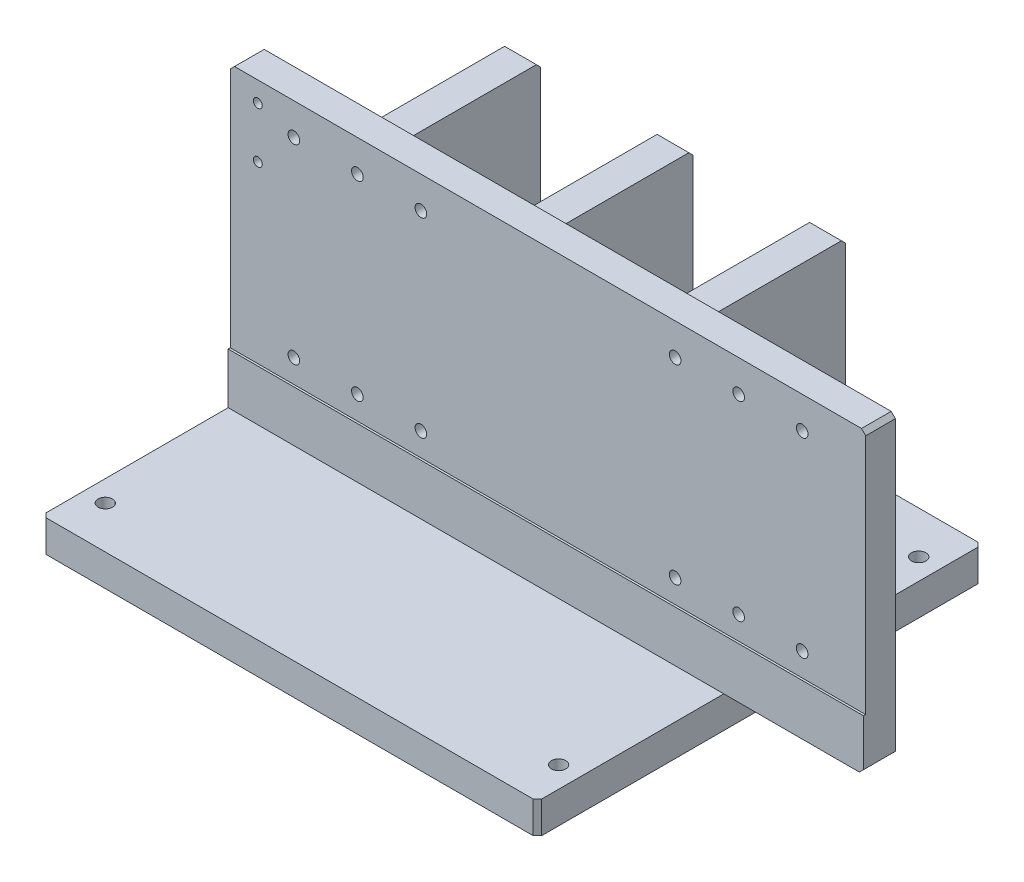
ISO-10303-21;
HEADER;
FILE_DESCRIPTION(('STEP AP214'),'2;1');
FILE_NAME('part.step','',(''),(''),'','','');
FILE_SCHEMA(('AUTOMOTIVE_DESIGN { 1 0 10303 214 1 1 1 1 }'));
ENDSEC;
DATA;
#1=APPLICATION_CONTEXT('core data for automotive mechanical design processes');
#2=APPLICATION_PROTOCOL_DEFINITION('international standard','automotive_design',2000,#1);
#3=PRODUCT_CONTEXT('',#1,'mechanical');
#4=PRODUCT('Part','Part','',(#3));
#5=PRODUCT_RELATED_PRODUCT_CATEGORY('part','',(#4));
#6=PRODUCT_DEFINITION_FORMATION('','',#4);
#7=PRODUCT_DEFINITION_CONTEXT('part definition',#1,'design');
#8=PRODUCT_DEFINITION('design','',#6,#7);
#9=PRODUCT_DEFINITION_SHAPE('','',#8);
#10=(LENGTH_UNIT() NAMED_UNIT(*) SI_UNIT(.MILLI.,.METRE.));
#11=(NAMED_UNIT(*) PLANE_ANGLE_UNIT() SI_UNIT($,.RADIAN.));
#12=(NAMED_UNIT(*) SI_UNIT($,.STERADIAN.) SOLID_ANGLE_UNIT());
#13=UNCERTAINTY_MEASURE_WITH_UNIT(LENGTH_MEASURE(1.E-05),#10,'distance_accuracy_value','');
#14=(GEOMETRIC_REPRESENTATION_CONTEXT(3) GLOBAL_UNCERTAINTY_ASSIGNED_CONTEXT((#13)) GLOBAL_UNIT_ASSIGNED_CONTEXT((#10,
#11,#12)) REPRESENTATION_CONTEXT('',''));
#15=CARTESIAN_POINT('',(0.,0.,0.));
#16=DIRECTION('',(0.,0.,1.));
#17=DIRECTION('',(1.,0.,0.));
#18=AXIS2_PLACEMENT_3D('',#15,#16,#17);
#19=CARTESIAN_POINT('',(64.5,135.,-78.));
#20=DIRECTION('',(1.,0.,0.));
#21=DIRECTION('',(0.,0.,-1.));
#22=AXIS2_PLACEMENT_3D('',#19,#20,#21);
#23=PLANE('',#22);
#24=DIRECTION('',(0.,0.,1.));
#25=VECTOR('',#24,1.);
#26=CARTESIAN_POINT('',(64.5,135.,-78.));
#27=LINE('',#26,#25);
#28=CARTESIAN_POINT('',(64.5,135.,-76.));
#29=VERTEX_POINT('',#28);
#30=CARTESIAN_POINT('',(64.5,135.,2.00000000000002));
#31=VERTEX_POINT('',#30);
#32=EDGE_CURVE('E105',#29,#31,#27,.T.);
#33=ORIENTED_EDGE('',*,*,#32,.F.);
#34=DIRECTION('',(0.,-0.707106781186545,-0.70710678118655));
#35=VECTOR('',#34,1.);
#36=CARTESIAN_POINT('',(64.5,134.,-77.));
#37=LINE('',#36,#35);
#38=CARTESIAN_POINT('',(64.5,133.,-78.));
#39=VERTEX_POINT('',#38);
#40=EDGE_CURVE('E59',#29,#39,#37,.T.);
#41=ORIENTED_EDGE('',*,*,#40,.T.);
#42=DIRECTION('',(0.,-1.,0.));
#43=VECTOR('',#42,1.);
#44=CARTESIAN_POINT('',(64.5,135.,-78.));
#45=LINE('',#44,#43);
#46=CARTESIAN_POINT('',(64.5,15.,-78.));
#47=VERTEX_POINT('',#46);
#48=EDGE_CURVE('E87',#39,#47,#45,.T.);
#49=ORIENTED_EDGE('',*,*,#48,.T.);
#50=DIRECTION('',(0.,0.,1.));
#51=VECTOR('',#50,1.);
#52=CARTESIAN_POINT('',(64.5,15.,-78.));
#53=LINE('',#52,#51);
#54=CARTESIAN_POINT('',(64.5,15.,2.00000000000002));
#55=VERTEX_POINT('',#54);
#56=EDGE_CURVE('E92',#47,#55,#53,.T.);
#57=ORIENTED_EDGE('',*,*,#56,.T.);
#58=DIRECTION('',(0.,-1.,0.));
#59=VECTOR('',#58,1.);
#60=CARTESIAN_POINT('',(64.5,135.,2.00000000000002));
#61=LINE('',#60,#59);
#62=EDGE_CURVE('E53',#31,#55,#61,.T.);
#63=ORIENTED_EDGE('',*,*,#62,.F.);
#64=EDGE_LOOP('',(#33,#41,#49,#57,#63));
#65=FACE_BOUND('',#64,.T.);
#66=ADVANCED_FACE('F46',(#65),#23,.F.);
#67=CARTESIAN_POINT('',(64.5,135.,2.00000000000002));
#68=DIRECTION('',(0.,0.,-1.));
#69=DIRECTION('',(-1.,0.,0.));
#70=AXIS2_PLACEMENT_3D('',#67,#68,#69);
#71=PLANE('',#70);
#72=DIRECTION('',(1.,0.,0.));
#73=VECTOR('',#72,1.);
#74=CARTESIAN_POINT('',(64.5,15.,2.00000000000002));
#75=LINE('',#74,#73);
#76=CARTESIAN_POINT('',(79.5,15.,2.00000000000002));
#77=VERTEX_POINT('',#76);
#78=EDGE_CURVE('E109',#55,#77,#75,.T.);
#79=ORIENTED_EDGE('',*,*,#78,.T.);
#80=DIRECTION('',(0.,-1.,0.));
#81=VECTOR('',#80,1.);
#82=CARTESIAN_POINT('',(79.5,135.,2.00000000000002));
#83=LINE('',#82,#81);
#84=CARTESIAN_POINT('',(79.5,135.,2.00000000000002));
#85=VERTEX_POINT('',#84);
#86=EDGE_CURVE('E120',#85,#77,#83,.T.);
#87=ORIENTED_EDGE('',*,*,#86,.F.);
#88=DIRECTION('',(1.,0.,0.));
#89=VECTOR('',#88,1.);
#90=CARTESIAN_POINT('',(64.5,135.,2.00000000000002));
#91=LINE('',#90,#89);
#92=EDGE_CURVE('E68',#31,#85,#91,.T.);
#93=ORIENTED_EDGE('',*,*,#92,.F.);
#94=ORIENTED_EDGE('',*,*,#62,.T.);
#95=EDGE_LOOP('',(#79,#87,#93,#94));
#96=FACE_BOUND('',#95,.T.);
#97=ADVANCED_FACE('F123',(#96),#71,.F.);
#98=CARTESIAN_POINT('',(79.5,135.,-78.));
#99=DIRECTION('',(-1.,0.,0.));
#100=DIRECTION('',(0.,0.,1.));
#101=AXIS2_PLACEMENT_3D('',#98,#99,#100);
#102=PLANE('',#101);
#103=DIRECTION('',(0.,-1.,0.));
#104=VECTOR('',#103,1.);
#105=CARTESIAN_POINT('',(79.5,135.,-78.));
#106=LINE('',#105,#104);
#107=CARTESIAN_POINT('',(79.5,133.,-78.));
#108=VERTEX_POINT('',#107);
#109=CARTESIAN_POINT('',(79.5,15.,-78.));
#110=VERTEX_POINT('',#109);
#111=EDGE_CURVE('E95',#108,#110,#106,.T.);
#112=ORIENTED_EDGE('',*,*,#111,.F.);
#113=DIRECTION('',(0.,-0.707106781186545,-0.70710678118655));
#114=VECTOR('',#113,1.);
#115=CARTESIAN_POINT('',(79.5,135.,-76.));
#116=LINE('',#115,#114);
#117=CARTESIAN_POINT('',(79.5,135.,-76.));
#118=VERTEX_POINT('',#117);
#119=EDGE_CURVE('E127',#118,#108,#116,.T.);
#120=ORIENTED_EDGE('',*,*,#119,.F.);
#121=DIRECTION('',(0.,0.,-1.));
#122=VECTOR('',#121,1.);
#123=CARTESIAN_POINT('',(79.5,135.,-78.));
#124=LINE('',#123,#122);
#125=EDGE_CURVE('E96',#85,#118,#124,.T.);
#126=ORIENTED_EDGE('',*,*,#125,.F.);
#127=ORIENTED_EDGE('',*,*,#86,.T.);
#128=DIRECTION('',(0.,0.,-1.));
#129=VECTOR('',#128,1.);
#130=CARTESIAN_POINT('',(79.5,15.,-78.));
#131=LINE('',#130,#129);
#132=EDGE_CURVE('E106',#77,#110,#131,.T.);
#133=ORIENTED_EDGE('',*,*,#132,.T.);
#134=EDGE_LOOP('',(#112,#120,#126,#127,#133));
#135=FACE_BOUND('',#134,.T.);
#136=ADVANCED_FACE('F136',(#135),#102,.F.);
#137=CARTESIAN_POINT('',(64.5,135.,-78.));
#138=DIRECTION('',(0.,0.,1.));
#139=DIRECTION('',(1.,0.,0.));
#140=AXIS2_PLACEMENT_3D('',#137,#138,#139);
#141=PLANE('',#140);
#142=ORIENTED_EDGE('',*,*,#48,.F.);
#143=DIRECTION('',(1.,0.,0.));
#144=VECTOR('',#143,1.);
#145=CARTESIAN_POINT('',(-117.,133.,-78.));
#146=LINE('',#145,#144);
#147=EDGE_CURVE('E113',#39,#108,#146,.T.);
#148=ORIENTED_EDGE('',*,*,#147,.T.);
#149=ORIENTED_EDGE('',*,*,#111,.T.);
#150=DIRECTION('',(-1.,0.,0.));
#151=VECTOR('',#150,1.);
#152=CARTESIAN_POINT('',(64.5,15.,-78.));
#153=LINE('',#152,#151);
#154=EDGE_CURVE('E99',#110,#47,#153,.T.);
#155=ORIENTED_EDGE('',*,*,#154,.T.);
#156=EDGE_LOOP('',(#142,#148,#149,#155));
#157=FACE_BOUND('',#156,.T.);
#158=ADVANCED_FACE('F100',(#157),#141,.F.);
#159=CARTESIAN_POINT('',(0.,135.,0.));
#160=DIRECTION('',(0.,1.,0.));
#161=DIRECTION('',(0.,0.,1.));
#162=AXIS2_PLACEMENT_3D('',#159,#160,#161);
#163=PLANE('',#162);
#164=DIRECTION('',(1.,0.,0.));
#165=VECTOR('',#164,1.);
#166=CARTESIAN_POINT('',(0.,135.,-76.));
#167=LINE('',#166,#165);
#168=EDGE_CURVE('E12',#29,#118,#167,.T.);
#169=ORIENTED_EDGE('',*,*,#168,.F.);
#170=ORIENTED_EDGE('',*,*,#32,.T.);
#171=ORIENTED_EDGE('',*,*,#92,.T.);
#172=ORIENTED_EDGE('',*,*,#125,.T.);
#173=EDGE_LOOP('',(#169,#170,#171,#172));
#174=FACE_BOUND('',#173,.T.);
#175=ADVANCED_FACE('F137',(#174),#163,.T.);
#176=CARTESIAN_POINT('',(0.,15.,0.));
#177=DIRECTION('',(0.,1.,0.));
#178=DIRECTION('',(0.,0.,1.));
#179=AXIS2_PLACEMENT_3D('',#176,#177,#178);
#180=PLANE('',#179);
#181=ORIENTED_EDGE('',*,*,#56,.F.);
#182=ORIENTED_EDGE('',*,*,#154,.F.);
#183=ORIENTED_EDGE('',*,*,#132,.F.);
#184=ORIENTED_EDGE('',*,*,#78,.F.);
#185=EDGE_LOOP('',(#181,#182,#183,#184));
#186=FACE_BOUND('',#185,.T.);
#187=ADVANCED_FACE('F108',(#186),#180,.F.);
#188=CARTESIAN_POINT('',(-117.,135.,-76.));
#189=DIRECTION('',(0.,-0.70710678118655,0.707106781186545));
#190=DIRECTION('',(0.,-0.707106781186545,-0.70710678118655));
#191=AXIS2_PLACEMENT_3D('',#188,#189,#190);
#192=PLANE('',#191);
#193=ORIENTED_EDGE('',*,*,#168,.T.);
#194=ORIENTED_EDGE('',*,*,#119,.T.);
#195=ORIENTED_EDGE('',*,*,#147,.F.);
#196=ORIENTED_EDGE('',*,*,#40,.F.);
#197=EDGE_LOOP('',(#193,#194,#195,#196));
#198=FACE_BOUND('',#197,.T.);
#199=ADVANCED_FACE('F131',(#198),#192,.F.);
#200=CLOSED_SHELL('',(#66,#97,#136,#158,#175,#187,#199));
#201=MANIFOLD_SOLID_BREP('B2',#200);
#202=CARTESIAN_POINT('',(-7.5,135.,-78.));
#203=DIRECTION('',(1.,0.,0.));
#204=DIRECTION('',(0.,0.,-1.));
#205=AXIS2_PLACEMENT_3D('',#202,#203,#204);
#206=PLANE('',#205);
#207=DIRECTION('',(0.,0.,1.));
#208=VECTOR('',#207,1.);
#209=CARTESIAN_POINT('',(-7.5,135.,-78.));
#210=LINE('',#209,#208);
#211=CARTESIAN_POINT('',(-7.5,135.,-76.));
#212=VERTEX_POINT('',#211);
#213=CARTESIAN_POINT('',(-7.5,135.,2.00000000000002));
#214=VERTEX_POINT('',#213);
#215=EDGE_CURVE('E266',#212,#214,#210,.T.);
#216=ORIENTED_EDGE('',*,*,#215,.F.);
#217=DIRECTION('',(0.,-0.707106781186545,-0.70710678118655));
#218=VECTOR('',#217,1.);
#219=CARTESIAN_POINT('',(-7.5,134.,-77.));
#220=LINE('',#219,#218);
#221=CARTESIAN_POINT('',(-7.50000000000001,133.,-78.));
#222=VERTEX_POINT('',#221);
#223=EDGE_CURVE('E219',#212,#222,#220,.T.);
#224=ORIENTED_EDGE('',*,*,#223,.T.);
#225=DIRECTION('',(0.,-1.,0.));
#226=VECTOR('',#225,1.);
#227=CARTESIAN_POINT('',(-7.5,135.,-78.));
#228=LINE('',#227,#226);
#229=CARTESIAN_POINT('',(-7.5,15.,-78.));
#230=VERTEX_POINT('',#229);
#231=EDGE_CURVE('E247',#222,#230,#228,.T.);
#232=ORIENTED_EDGE('',*,*,#231,.T.);
#233=DIRECTION('',(0.,0.,1.));
#234=VECTOR('',#233,1.);
#235=CARTESIAN_POINT('',(-7.5,15.,-78.));
#236=LINE('',#235,#234);
#237=CARTESIAN_POINT('',(-7.5,15.,2.00000000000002));
#238=VERTEX_POINT('',#237);
#239=EDGE_CURVE('E252',#230,#238,#236,.T.);
#240=ORIENTED_EDGE('',*,*,#239,.T.);
#241=DIRECTION('',(0.,-1.,0.));
#242=VECTOR('',#241,1.);
#243=CARTESIAN_POINT('',(-7.5,135.,2.00000000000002));
#244=LINE('',#243,#242);
#245=EDGE_CURVE('E213',#214,#238,#244,.T.);
#246=ORIENTED_EDGE('',*,*,#245,.F.);
#247=EDGE_LOOP('',(#216,#224,#232,#240,#246));
#248=FACE_BOUND('',#247,.T.);
#249=ADVANCED_FACE('F206',(#248),#206,.F.);
#250=CARTESIAN_POINT('',(-7.5,135.,2.00000000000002));
#251=DIRECTION('',(0.,0.,-1.));
#252=DIRECTION('',(-1.,0.,0.));
#253=AXIS2_PLACEMENT_3D('',#250,#251,#252);
#254=PLANE('',#253);
#255=DIRECTION('',(1.,0.,0.));
#256=VECTOR('',#255,1.);
#257=CARTESIAN_POINT('',(-7.5,15.,2.00000000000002));
#258=LINE('',#257,#256);
#259=CARTESIAN_POINT('',(7.49999999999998,15.,2.00000000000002));
#260=VERTEX_POINT('',#259);
#261=EDGE_CURVE('E270',#238,#260,#258,.T.);
#262=ORIENTED_EDGE('',*,*,#261,.T.);
#263=DIRECTION('',(0.,-1.,0.));
#264=VECTOR('',#263,1.);
#265=CARTESIAN_POINT('',(7.49999999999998,135.,2.00000000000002));
#266=LINE('',#265,#264);
#267=CARTESIAN_POINT('',(7.49999999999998,135.,2.00000000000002));
#268=VERTEX_POINT('',#267);
#269=EDGE_CURVE('E281',#268,#260,#266,.T.);
#270=ORIENTED_EDGE('',*,*,#269,.F.);
#271=DIRECTION('',(1.,0.,0.));
#272=VECTOR('',#271,1.);
#273=CARTESIAN_POINT('',(-7.5,135.,2.00000000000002));
#274=LINE('',#273,#272);
#275=EDGE_CURVE('E228',#214,#268,#274,.T.);
#276=ORIENTED_EDGE('',*,*,#275,.F.);
#277=ORIENTED_EDGE('',*,*,#245,.T.);
#278=EDGE_LOOP('',(#262,#270,#276,#277));
#279=FACE_BOUND('',#278,.T.);
#280=ADVANCED_FACE('F284',(#279),#254,.F.);
#281=CARTESIAN_POINT('',(7.5,135.,-78.));
#282=DIRECTION('',(-1.,0.,0.));
#283=DIRECTION('',(0.,0.,1.));
#284=AXIS2_PLACEMENT_3D('',#281,#282,#283);
#285=PLANE('',#284);
#286=DIRECTION('',(0.,-1.,0.));
#287=VECTOR('',#286,1.);
#288=CARTESIAN_POINT('',(7.5,135.,-78.));
#289=LINE('',#288,#287);
#290=CARTESIAN_POINT('',(7.50000000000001,133.,-78.));
#291=VERTEX_POINT('',#290);
#292=CARTESIAN_POINT('',(7.5,15.,-78.));
#293=VERTEX_POINT('',#292);
#294=EDGE_CURVE('E256',#291,#293,#289,.T.);
#295=ORIENTED_EDGE('',*,*,#294,.F.);
#296=DIRECTION('',(0.,0.707106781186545,0.70710678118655));
#297=VECTOR('',#296,1.);
#298=CARTESIAN_POINT('',(7.5,134.,-77.));
#299=LINE('',#298,#297);
#300=CARTESIAN_POINT('',(7.50000000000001,135.,-76.));
#301=VERTEX_POINT('',#300);
#302=EDGE_CURVE('E274',#291,#301,#299,.T.);
#303=ORIENTED_EDGE('',*,*,#302,.T.);
#304=DIRECTION('',(0.,0.,-1.));
#305=VECTOR('',#304,1.);
#306=CARTESIAN_POINT('',(7.5,135.,-78.));
#307=LINE('',#306,#305);
#308=EDGE_CURVE('E257',#268,#301,#307,.T.);
#309=ORIENTED_EDGE('',*,*,#308,.F.);
#310=ORIENTED_EDGE('',*,*,#269,.T.);
#311=DIRECTION('',(0.,0.,-1.));
#312=VECTOR('',#311,1.);
#313=CARTESIAN_POINT('',(7.5,15.,-78.));
#314=LINE('',#313,#312);
#315=EDGE_CURVE('E267',#260,#293,#314,.T.);
#316=ORIENTED_EDGE('',*,*,#315,.T.);
#317=EDGE_LOOP('',(#295,#303,#309,#310,#316));
#318=FACE_BOUND('',#317,.T.);
#319=ADVANCED_FACE('F292',(#318),#285,.F.);
#320=CARTESIAN_POINT('',(-7.5,135.,-78.));
#321=DIRECTION('',(0.,0.,1.));
#322=DIRECTION('',(1.,0.,0.));
#323=AXIS2_PLACEMENT_3D('',#320,#321,#322);
#324=PLANE('',#323);
#325=ORIENTED_EDGE('',*,*,#231,.F.);
#326=DIRECTION('',(1.,0.,0.));
#327=VECTOR('',#326,1.);
#328=CARTESIAN_POINT('',(-117.,133.,-78.));
#329=LINE('',#328,#327);
#330=EDGE_CURVE('E289',#222,#291,#329,.T.);
#331=ORIENTED_EDGE('',*,*,#330,.T.);
#332=ORIENTED_EDGE('',*,*,#294,.T.);
#333=DIRECTION('',(-1.,0.,0.));
#334=VECTOR('',#333,1.);
#335=CARTESIAN_POINT('',(-7.5,15.,-78.));
#336=LINE('',#335,#334);
#337=EDGE_CURVE('E260',#293,#230,#336,.T.);
#338=ORIENTED_EDGE('',*,*,#337,.T.);
#339=EDGE_LOOP('',(#325,#331,#332,#338));
#340=FACE_BOUND('',#339,.T.);
#341=ADVANCED_FACE('F261',(#340),#324,.F.);
#342=CARTESIAN_POINT('',(0.,135.,0.));
#343=DIRECTION('',(0.,1.,0.));
#344=DIRECTION('',(0.,0.,1.));
#345=AXIS2_PLACEMENT_3D('',#342,#343,#344);
#346=PLANE('',#345);
#347=DIRECTION('',(1.,0.,0.));
#348=VECTOR('',#347,1.);
#349=CARTESIAN_POINT('',(0.,135.,-76.));
#350=LINE('',#349,#348);
#351=EDGE_CURVE('E44',#212,#301,#350,.T.);
#352=ORIENTED_EDGE('',*,*,#351,.F.);
#353=ORIENTED_EDGE('',*,*,#215,.T.);
#354=ORIENTED_EDGE('',*,*,#275,.T.);
#355=ORIENTED_EDGE('',*,*,#308,.T.);
#356=EDGE_LOOP('',(#352,#353,#354,#355));
#357=FACE_BOUND('',#356,.T.);
#358=ADVANCED_FACE('F295',(#357),#346,.T.);
#359=CARTESIAN_POINT('',(0.,15.,0.));
#360=DIRECTION('',(0.,1.,0.));
#361=DIRECTION('',(0.,0.,1.));
#362=AXIS2_PLACEMENT_3D('',#359,#360,#361);
#363=PLANE('',#362);
#364=ORIENTED_EDGE('',*,*,#239,.F.);
#365=ORIENTED_EDGE('',*,*,#337,.F.);
#366=ORIENTED_EDGE('',*,*,#315,.F.);
#367=ORIENTED_EDGE('',*,*,#261,.F.);
#368=EDGE_LOOP('',(#364,#365,#366,#367));
#369=FACE_BOUND('',#368,.T.);
#370=ADVANCED_FACE('F269',(#369),#363,.F.);
#371=CARTESIAN_POINT('',(-117.,135.,-76.));
#372=DIRECTION('',(0.,-0.70710678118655,0.707106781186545));
#373=DIRECTION('',(0.,-0.707106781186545,-0.70710678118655));
#374=AXIS2_PLACEMENT_3D('',#371,#372,#373);
#375=PLANE('',#374);
#376=ORIENTED_EDGE('',*,*,#351,.T.);
#377=ORIENTED_EDGE('',*,*,#302,.F.);
#378=ORIENTED_EDGE('',*,*,#330,.F.);
#379=ORIENTED_EDGE('',*,*,#223,.F.);
#380=EDGE_LOOP('',(#376,#377,#378,#379));
#381=FACE_BOUND('',#380,.T.);
#382=ADVANCED_FACE('F298',(#381),#375,.F.);
#383=CLOSED_SHELL('',(#249,#280,#319,#341,#358,#370,#382));
#384=MANIFOLD_SOLID_BREP('B6',#383);
#385=CARTESIAN_POINT('',(-79.5,135.,-78.));
#386=DIRECTION('',(1.,0.,0.));
#387=DIRECTION('',(0.,0.,-1.));
#388=AXIS2_PLACEMENT_3D('',#385,#386,#387);
#389=PLANE('',#388);
#390=DIRECTION('',(0.,0.,1.));
#391=VECTOR('',#390,1.);
#392=CARTESIAN_POINT('',(-79.5,135.,-78.));
#393=LINE('',#392,#391);
#394=CARTESIAN_POINT('',(-79.5,135.,-76.));
#395=VERTEX_POINT('',#394);
#396=CARTESIAN_POINT('',(-79.5,135.,2.00000000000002));
#397=VERTEX_POINT('',#396);
#398=EDGE_CURVE('E426',#395,#397,#393,.T.);
#399=ORIENTED_EDGE('',*,*,#398,.F.);
#400=DIRECTION('',(0.,-0.707106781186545,-0.70710678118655));
#401=VECTOR('',#400,1.);
#402=CARTESIAN_POINT('',(-79.5,134.,-77.));
#403=LINE('',#402,#401);
#404=CARTESIAN_POINT('',(-79.5,133.,-78.));
#405=VERTEX_POINT('',#404);
#406=EDGE_CURVE('E379',#395,#405,#403,.T.);
#407=ORIENTED_EDGE('',*,*,#406,.T.);
#408=DIRECTION('',(0.,-1.,0.));
#409=VECTOR('',#408,1.);
#410=CARTESIAN_POINT('',(-79.5,135.,-78.));
#411=LINE('',#410,#409);
#412=CARTESIAN_POINT('',(-79.5,15.,-78.));
#413=VERTEX_POINT('',#412);
#414=EDGE_CURVE('E407',#405,#413,#411,.T.);
#415=ORIENTED_EDGE('',*,*,#414,.T.);
#416=DIRECTION('',(0.,0.,1.));
#417=VECTOR('',#416,1.);
#418=CARTESIAN_POINT('',(-79.5,15.,-78.));
#419=LINE('',#418,#417);
#420=CARTESIAN_POINT('',(-79.5,15.,2.00000000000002));
#421=VERTEX_POINT('',#420);
#422=EDGE_CURVE('E412',#413,#421,#419,.T.);
#423=ORIENTED_EDGE('',*,*,#422,.T.);
#424=DIRECTION('',(0.,-1.,0.));
#425=VECTOR('',#424,1.);
#426=CARTESIAN_POINT('',(-79.5,135.,2.00000000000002));
#427=LINE('',#426,#425);
#428=EDGE_CURVE('E373',#397,#421,#427,.T.);
#429=ORIENTED_EDGE('',*,*,#428,.F.);
#430=EDGE_LOOP('',(#399,#407,#415,#423,#429));
#431=FACE_BOUND('',#430,.T.);
#432=ADVANCED_FACE('F366',(#431),#389,.F.);
#433=CARTESIAN_POINT('',(-79.5,135.,2.00000000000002));
#434=DIRECTION('',(0.,0.,-1.));
#435=DIRECTION('',(-1.,0.,0.));
#436=AXIS2_PLACEMENT_3D('',#433,#434,#435);
#437=PLANE('',#436);
#438=DIRECTION('',(1.,0.,0.));
#439=VECTOR('',#438,1.);
#440=CARTESIAN_POINT('',(-79.5,15.,2.00000000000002));
#441=LINE('',#440,#439);
#442=CARTESIAN_POINT('',(-64.5,15.,2.00000000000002));
#443=VERTEX_POINT('',#442);
#444=EDGE_CURVE('E430',#421,#443,#441,.T.);
#445=ORIENTED_EDGE('',*,*,#444,.T.);
#446=DIRECTION('',(0.,-1.,0.));
#447=VECTOR('',#446,1.);
#448=CARTESIAN_POINT('',(-64.5,135.,2.00000000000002));
#449=LINE('',#448,#447);
#450=CARTESIAN_POINT('',(-64.5,135.,2.00000000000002));
#451=VERTEX_POINT('',#450);
#452=EDGE_CURVE('E441',#451,#443,#449,.T.);
#453=ORIENTED_EDGE('',*,*,#452,.F.);
#454=DIRECTION('',(1.,0.,0.));
#455=VECTOR('',#454,1.);
#456=CARTESIAN_POINT('',(-79.5,135.,2.00000000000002));
#457=LINE('',#456,#455);
#458=EDGE_CURVE('E388',#397,#451,#457,.T.);
#459=ORIENTED_EDGE('',*,*,#458,.F.);
#460=ORIENTED_EDGE('',*,*,#428,.T.);
#461=EDGE_LOOP('',(#445,#453,#459,#460));
#462=FACE_BOUND('',#461,.T.);
#463=ADVANCED_FACE('F444',(#462),#437,.F.);
#464=CARTESIAN_POINT('',(-64.5,135.,-78.));
#465=DIRECTION('',(-1.,0.,0.));
#466=DIRECTION('',(0.,0.,1.));
#467=AXIS2_PLACEMENT_3D('',#464,#465,#466);
#468=PLANE('',#467);
#469=DIRECTION('',(0.,-1.,0.));
#470=VECTOR('',#469,1.);
#471=CARTESIAN_POINT('',(-64.5,135.,-78.));
#472=LINE('',#471,#470);
#473=CARTESIAN_POINT('',(-64.5,133.,-78.));
#474=VERTEX_POINT('',#473);
#475=CARTESIAN_POINT('',(-64.5,15.,-78.));
#476=VERTEX_POINT('',#475);
#477=EDGE_CURVE('E416',#474,#476,#472,.T.);
#478=ORIENTED_EDGE('',*,*,#477,.F.);
#479=DIRECTION('',(0.,0.707106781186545,0.70710678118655));
#480=VECTOR('',#479,1.);
#481=CARTESIAN_POINT('',(-64.5,134.,-77.));
#482=LINE('',#481,#480);
#483=CARTESIAN_POINT('',(-64.5,135.,-76.));
#484=VERTEX_POINT('',#483);
#485=EDGE_CURVE('E434',#474,#484,#482,.T.);
#486=ORIENTED_EDGE('',*,*,#485,.T.);
#487=DIRECTION('',(0.,0.,-1.));
#488=VECTOR('',#487,1.);
#489=CARTESIAN_POINT('',(-64.5,135.,-78.));
#490=LINE('',#489,#488);
#491=EDGE_CURVE('E417',#451,#484,#490,.T.);
#492=ORIENTED_EDGE('',*,*,#491,.F.);
#493=ORIENTED_EDGE('',*,*,#452,.T.);
#494=DIRECTION('',(0.,0.,-1.));
#495=VECTOR('',#494,1.);
#496=CARTESIAN_POINT('',(-64.5,15.,-78.));
#497=LINE('',#496,#495);
#498=EDGE_CURVE('E427',#443,#476,#497,.T.);
#499=ORIENTED_EDGE('',*,*,#498,.T.);
#500=EDGE_LOOP('',(#478,#486,#492,#493,#499));
#501=FACE_BOUND('',#500,.T.);
#502=ADVANCED_FACE('F452',(#501),#468,.F.);
#503=CARTESIAN_POINT('',(-79.5,135.,-78.));
#504=DIRECTION('',(0.,0.,1.));
#505=DIRECTION('',(1.,0.,0.));
#506=AXIS2_PLACEMENT_3D('',#503,#504,#505);
#507=PLANE('',#506);
#508=ORIENTED_EDGE('',*,*,#414,.F.);
#509=DIRECTION('',(1.,0.,0.));
#510=VECTOR('',#509,1.);
#511=CARTESIAN_POINT('',(-117.,133.,-78.));
#512=LINE('',#511,#510);
#513=EDGE_CURVE('E449',#405,#474,#512,.T.);
#514=ORIENTED_EDGE('',*,*,#513,.T.);
#515=ORIENTED_EDGE('',*,*,#477,.T.);
#516=DIRECTION('',(-1.,0.,0.));
#517=VECTOR('',#516,1.);
#518=CARTESIAN_POINT('',(-79.5,15.,-78.));
#519=LINE('',#518,#517);
#520=EDGE_CURVE('E420',#476,#413,#519,.T.);
#521=ORIENTED_EDGE('',*,*,#520,.T.);
#522=EDGE_LOOP('',(#508,#514,#515,#521));
#523=FACE_BOUND('',#522,.T.);
#524=ADVANCED_FACE('F421',(#523),#507,.F.);
#525=CARTESIAN_POINT('',(0.,135.,0.));
#526=DIRECTION('',(0.,1.,0.));
#527=DIRECTION('',(0.,0.,1.));
#528=AXIS2_PLACEMENT_3D('',#525,#526,#527);
#529=PLANE('',#528);
#530=DIRECTION('',(1.,0.,0.));
#531=VECTOR('',#530,1.);
#532=CARTESIAN_POINT('',(0.,135.,-76.));
#533=LINE('',#532,#531);
#534=EDGE_CURVE('E204',#395,#484,#533,.T.);
#535=ORIENTED_EDGE('',*,*,#534,.F.);
#536=ORIENTED_EDGE('',*,*,#398,.T.);
#537=ORIENTED_EDGE('',*,*,#458,.T.);
#538=ORIENTED_EDGE('',*,*,#491,.T.);
#539=EDGE_LOOP('',(#535,#536,#537,#538));
#540=FACE_BOUND('',#539,.T.);
#541=ADVANCED_FACE('F455',(#540),#529,.T.);
#542=CARTESIAN_POINT('',(0.,15.,0.));
#543=DIRECTION('',(0.,1.,0.));
#544=DIRECTION('',(0.,0.,1.));
#545=AXIS2_PLACEMENT_3D('',#542,#543,#544);
#546=PLANE('',#545);
#547=ORIENTED_EDGE('',*,*,#422,.F.);
#548=ORIENTED_EDGE('',*,*,#520,.F.);
#549=ORIENTED_EDGE('',*,*,#498,.F.);
#550=ORIENTED_EDGE('',*,*,#444,.F.);
#551=EDGE_LOOP('',(#547,#548,#549,#550));
#552=FACE_BOUND('',#551,.T.);
#553=ADVANCED_FACE('F429',(#552),#546,.F.);
#554=CARTESIAN_POINT('',(-117.,135.,-76.));
#555=DIRECTION('',(0.,-0.70710678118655,0.707106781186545));
#556=DIRECTION('',(0.,-0.707106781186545,-0.70710678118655));
#557=AXIS2_PLACEMENT_3D('',#554,#555,#556);
#558=PLANE('',#557);
#559=ORIENTED_EDGE('',*,*,#534,.T.);
#560=ORIENTED_EDGE('',*,*,#485,.F.);
#561=ORIENTED_EDGE('',*,*,#513,.F.);
#562=ORIENTED_EDGE('',*,*,#406,.F.);
#563=EDGE_LOOP('',(#559,#560,#561,#562));
#564=FACE_BOUND('',#563,.T.);
#565=ADVANCED_FACE('F458',(#564),#558,.F.);
#566=CLOSED_SHELL('',(#432,#463,#502,#524,#541,#553,#565));
#567=MANIFOLD_SOLID_BREP('B38',#566);
#568=CARTESIAN_POINT('',(0.,155.,0.));
#569=DIRECTION('',(0.,1.,0.));
#570=DIRECTION('',(0.,0.,1.));
#571=AXIS2_PLACEMENT_3D('',#568,#569,#570);
#572=PLANE('',#571);
#573=DIRECTION('',(-1.,0.,0.));
#574=VECTOR('',#573,1.);
#575=CARTESIAN_POINT('',(-117.,155.,2.00000000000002));
#576=LINE('',#575,#574);
#577=CARTESIAN_POINT('',(181.,155.,2.00000000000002));
#578=VERTEX_POINT('',#577);
#579=CARTESIAN_POINT('',(-115.,155.,2.00000000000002));
#580=VERTEX_POINT('',#579);
#581=EDGE_CURVE('E628',#578,#580,#576,.T.);
#582=ORIENTED_EDGE('',*,*,#581,.T.);
#583=DIRECTION('',(0.,0.,1.));
#584=VECTOR('',#583,1.);
#585=CARTESIAN_POINT('',(-115.,155.,16.));
#586=LINE('',#585,#584);
#587=CARTESIAN_POINT('',(-115.,155.,16.));
#588=VERTEX_POINT('',#587);
#589=EDGE_CURVE('E687',#580,#588,#586,.T.);
#590=ORIENTED_EDGE('',*,*,#589,.T.);
#591=DIRECTION('',(-1.,0.,0.));
#592=VECTOR('',#591,1.);
#593=CARTESIAN_POINT('',(-117.,155.,16.));
#594=LINE('',#593,#592);
#595=CARTESIAN_POINT('',(181.,155.,16.));
#596=VERTEX_POINT('',#595);
#597=EDGE_CURVE('E621',#596,#588,#594,.T.);
#598=ORIENTED_EDGE('',*,*,#597,.F.);
#599=DIRECTION('',(0.,0.,-1.));
#600=VECTOR('',#599,1.);
#601=CARTESIAN_POINT('',(181.,155.,2.00000000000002));
#602=LINE('',#601,#600);
#603=EDGE_CURVE('E645',#596,#578,#602,.T.);
#604=ORIENTED_EDGE('',*,*,#603,.T.);
#605=EDGE_LOOP('',(#582,#590,#598,#604));
#606=FACE_BOUND('',#605,.T.);
#607=ADVANCED_FACE('F525',(#606),#572,.T.);
#608=CARTESIAN_POINT('',(-117.,155.,2.00000000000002));
#609=DIRECTION('',(1.,0.,0.));
#610=DIRECTION('',(0.,0.,-1.));
#611=AXIS2_PLACEMENT_3D('',#608,#609,#610);
#612=PLANE('',#611);
#613=DIRECTION('',(0.,-1.,0.));
#614=VECTOR('',#613,1.);
#615=CARTESIAN_POINT('',(-117.,155.,16.));
#616=LINE('',#615,#614);
#617=CARTESIAN_POINT('',(-117.,153.,16.));
#618=VERTEX_POINT('',#617);
#619=CARTESIAN_POINT('',(-117.,39.,16.));
#620=VERTEX_POINT('',#619);
#621=EDGE_CURVE('E596',#618,#620,#616,.T.);
#622=ORIENTED_EDGE('',*,*,#621,.F.);
#623=DIRECTION('',(0.,0.,-1.));
#624=VECTOR('',#623,1.);
#625=CARTESIAN_POINT('',(-117.,153.,2.00000000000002));
#626=LINE('',#625,#624);
#627=CARTESIAN_POINT('',(-117.,153.,2.00000000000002));
#628=VERTEX_POINT('',#627);
#629=EDGE_CURVE('E693',#618,#628,#626,.T.);
#630=ORIENTED_EDGE('',*,*,#629,.T.);
#631=DIRECTION('',(0.,-1.,0.));
#632=VECTOR('',#631,1.);
#633=CARTESIAN_POINT('',(-117.,155.,2.00000000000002));
#634=LINE('',#633,#632);
#635=CARTESIAN_POINT('',(-117.,15.,2.00000000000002));
#636=VERTEX_POINT('',#635);
#637=EDGE_CURVE('E631',#628,#636,#634,.T.);
#638=ORIENTED_EDGE('',*,*,#637,.T.);
#639=DIRECTION('',(0.,0.,1.));
#640=VECTOR('',#639,1.);
#641=CARTESIAN_POINT('',(-117.,15.,2.00000000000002));
#642=LINE('',#641,#640);
#643=CARTESIAN_POINT('',(-117.,15.,17.));
#644=VERTEX_POINT('',#643);
#645=EDGE_CURVE('E623',#636,#644,#642,.T.);
#646=ORIENTED_EDGE('',*,*,#645,.T.);
#647=DIRECTION('',(0.,-1.,0.));
#648=VECTOR('',#647,1.);
#649=CARTESIAN_POINT('',(-117.,155.,17.));
#650=LINE('',#649,#648);
#651=CARTESIAN_POINT('',(-117.,39.,17.));
#652=VERTEX_POINT('',#651);
#653=EDGE_CURVE('E620',#652,#644,#650,.T.);
#654=ORIENTED_EDGE('',*,*,#653,.F.);
#655=DIRECTION('',(0.,0.,1.));
#656=VECTOR('',#655,1.);
#657=CARTESIAN_POINT('',(-117.,39.,16.));
#658=LINE('',#657,#656);
#659=EDGE_CURVE('E611',#620,#652,#658,.T.);
#660=ORIENTED_EDGE('',*,*,#659,.F.);
#661=EDGE_LOOP('',(#622,#630,#638,#646,#654,#660));
#662=FACE_BOUND('',#661,.T.);
#663=ADVANCED_FACE('F618',(#662),#612,.F.);
#664=CARTESIAN_POINT('',(-117.,155.,17.));
#665=DIRECTION('',(0.,0.,-1.));
#666=DIRECTION('',(-1.,0.,0.));
#667=AXIS2_PLACEMENT_3D('',#664,#665,#666);
#668=PLANE('',#667);
#669=DIRECTION('',(1.,0.,0.));
#670=VECTOR('',#669,1.);
#671=CARTESIAN_POINT('',(-117.,15.,17.));
#672=LINE('',#671,#670);
#673=CARTESIAN_POINT('',(181.,15.,17.));
#674=VERTEX_POINT('',#673);
#675=EDGE_CURVE('E634',#644,#674,#672,.T.);
#676=ORIENTED_EDGE('',*,*,#675,.T.);
#677=DIRECTION('',(-0.707106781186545,-0.70710678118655,0.));
#678=VECTOR('',#677,1.);
#679=CARTESIAN_POINT('',(183.,17.,17.));
#680=LINE('',#679,#678);
#681=CARTESIAN_POINT('',(183.,17.,17.));
#682=VERTEX_POINT('',#681);
#683=EDGE_CURVE('E364',#674,#682,#680,.F.);
#684=ORIENTED_EDGE('',*,*,#683,.T.);
#685=DIRECTION('',(0.,-1.,0.));
#686=VECTOR('',#685,1.);
#687=CARTESIAN_POINT('',(183.,155.,17.));
#688=LINE('',#687,#686);
#689=CARTESIAN_POINT('',(183.,39.,17.));
#690=VERTEX_POINT('',#689);
#691=EDGE_CURVE('E642',#690,#682,#688,.T.);
#692=ORIENTED_EDGE('',*,*,#691,.F.);
#693=DIRECTION('',(1.,0.,0.));
#694=VECTOR('',#693,1.);
#695=CARTESIAN_POINT('',(-117.,39.,17.));
#696=LINE('',#695,#694);
#697=EDGE_CURVE('E607',#652,#690,#696,.T.);
#698=ORIENTED_EDGE('',*,*,#697,.F.);
#699=ORIENTED_EDGE('',*,*,#653,.T.);
#700=EDGE_LOOP('',(#676,#684,#692,#698,#699));
#701=FACE_BOUND('',#700,.T.);
#702=ADVANCED_FACE('F722',(#701),#668,.F.);
#703=CARTESIAN_POINT('',(183.,155.,2.00000000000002));
#704=DIRECTION('',(-1.,0.,0.));
#705=DIRECTION('',(0.,0.,1.));
#706=AXIS2_PLACEMENT_3D('',#703,#704,#705);
#707=PLANE('',#706);
#708=ORIENTED_EDGE('',*,*,#691,.T.);
#709=DIRECTION('',(0.,0.,-1.));
#710=VECTOR('',#709,1.);
#711=CARTESIAN_POINT('',(183.,17.,2.00000000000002));
#712=LINE('',#711,#710);
#713=CARTESIAN_POINT('',(183.,17.,2.00000000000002));
#714=VERTEX_POINT('',#713);
#715=EDGE_CURVE('E703',#682,#714,#712,.T.);
#716=ORIENTED_EDGE('',*,*,#715,.T.);
#717=DIRECTION('',(0.,-1.,0.));
#718=VECTOR('',#717,1.);
#719=CARTESIAN_POINT('',(183.,155.,2.00000000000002));
#720=LINE('',#719,#718);
#721=CARTESIAN_POINT('',(183.,153.,2.00000000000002));
#722=VERTEX_POINT('',#721);
#723=EDGE_CURVE('E639',#722,#714,#720,.T.);
#724=ORIENTED_EDGE('',*,*,#723,.F.);
#725=DIRECTION('',(0.,0.,1.));
#726=VECTOR('',#725,1.);
#727=CARTESIAN_POINT('',(183.,153.,16.));
#728=LINE('',#727,#726);
#729=CARTESIAN_POINT('',(183.,153.,16.));
#730=VERTEX_POINT('',#729);
#731=EDGE_CURVE('E701',#722,#730,#728,.T.);
#732=ORIENTED_EDGE('',*,*,#731,.T.);
#733=DIRECTION('',(0.,1.,0.));
#734=VECTOR('',#733,1.);
#735=CARTESIAN_POINT('',(183.,155.,16.));
#736=LINE('',#735,#734);
#737=CARTESIAN_POINT('',(183.,39.,16.));
#738=VERTEX_POINT('',#737);
#739=EDGE_CURVE('E615',#738,#730,#736,.T.);
#740=ORIENTED_EDGE('',*,*,#739,.F.);
#741=DIRECTION('',(0.,0.,1.));
#742=VECTOR('',#741,1.);
#743=CARTESIAN_POINT('',(183.,39.,16.));
#744=LINE('',#743,#742);
#745=EDGE_CURVE('E614',#738,#690,#744,.T.);
#746=ORIENTED_EDGE('',*,*,#745,.T.);
#747=EDGE_LOOP('',(#708,#716,#724,#732,#740,#746));
#748=FACE_BOUND('',#747,.T.);
#749=ADVANCED_FACE('F708',(#748),#707,.F.);
#750=CARTESIAN_POINT('',(-117.,155.,2.00000000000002));
#751=DIRECTION('',(0.,0.,1.));
#752=DIRECTION('',(1.,0.,0.));
#753=AXIS2_PLACEMENT_3D('',#750,#751,#752);
#754=PLANE('',#753);
#755=CARTESIAN_POINT('',(-104.,145.5,2.00000000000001));
#756=DIRECTION('',(0.,0.,-1.));
#757=DIRECTION('',(-1.,0.,0.));
#758=AXIS2_PLACEMENT_3D('',#755,#756,#757);
#759=CIRCLE('',#758,2.525);
#760=CARTESIAN_POINT('',(-106.525,145.5,2.00000000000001));
#761=VERTEX_POINT('',#760);
#762=EDGE_CURVE('E748',#761,#761,#759,.T.);
#763=ORIENTED_EDGE('',*,*,#762,.F.);
#764=EDGE_LOOP('',(#763));
#765=FACE_BOUND('',#764,.T.);
#766=CARTESIAN_POINT('',(-104.,121.5,2.00000000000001));
#767=DIRECTION('',(0.,0.,-1.));
#768=DIRECTION('',(-1.,0.,0.));
#769=AXIS2_PLACEMENT_3D('',#766,#767,#768);
#770=CIRCLE('',#769,2.525);
#771=CARTESIAN_POINT('',(-106.525,121.5,2.00000000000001));
#772=VERTEX_POINT('',#771);
#773=EDGE_CURVE('E683',#772,#772,#770,.T.);
#774=ORIENTED_EDGE('',*,*,#773,.F.);
#775=EDGE_LOOP('',(#774));
#776=FACE_BOUND('',#775,.T.);
#777=CARTESIAN_POINT('',(123.,140.,2.00000000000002));
#778=DIRECTION('',(0.,0.,-1.));
#779=DIRECTION('',(-1.,0.,0.));
#780=AXIS2_PLACEMENT_3D('',#777,#778,#779);
#781=CIRCLE('',#780,4.75);
#782=CARTESIAN_POINT('',(118.25,140.,2.00000000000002));
#783=VERTEX_POINT('',#782);
#784=EDGE_CURVE('E678',#783,#783,#781,.T.);
#785=ORIENTED_EDGE('',*,*,#784,.F.);
#786=EDGE_LOOP('',(#785));
#787=FACE_BOUND('',#786,.T.);
#788=CARTESIAN_POINT('',(93.,140.,2.00000000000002));
#789=DIRECTION('',(0.,0.,-1.));
#790=DIRECTION('',(-1.,0.,0.));
#791=AXIS2_PLACEMENT_3D('',#788,#789,#790);
#792=CIRCLE('',#791,4.75);
#793=CARTESIAN_POINT('',(88.25,140.,2.00000000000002));
#794=VERTEX_POINT('',#793);
#795=EDGE_CURVE('E758',#794,#794,#792,.T.);
#796=ORIENTED_EDGE('',*,*,#795,.F.);
#797=EDGE_LOOP('',(#796));
#798=FACE_BOUND('',#797,.T.);
#799=CARTESIAN_POINT('',(153.,50.,2.00000000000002));
#800=DIRECTION('',(0.,0.,-1.));
#801=DIRECTION('',(-1.,0.,0.));
#802=AXIS2_PLACEMENT_3D('',#799,#800,#801);
#803=CIRCLE('',#802,4.75);
#804=CARTESIAN_POINT('',(148.25,50.,2.00000000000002));
#805=VERTEX_POINT('',#804);
#806=EDGE_CURVE('E762',#805,#805,#803,.T.);
#807=ORIENTED_EDGE('',*,*,#806,.F.);
#808=EDGE_LOOP('',(#807));
#809=FACE_BOUND('',#808,.T.);
#810=CARTESIAN_POINT('',(123.,50.,2.00000000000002));
#811=DIRECTION('',(0.,0.,-1.));
#812=DIRECTION('',(-1.,0.,0.));
#813=AXIS2_PLACEMENT_3D('',#810,#811,#812);
#814=CIRCLE('',#813,4.75);
#815=CARTESIAN_POINT('',(118.25,50.,2.00000000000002));
#816=VERTEX_POINT('',#815);
#817=EDGE_CURVE('E766',#816,#816,#814,.T.);
#818=ORIENTED_EDGE('',*,*,#817,.F.);
#819=EDGE_LOOP('',(#818));
#820=FACE_BOUND('',#819,.T.);
#821=CARTESIAN_POINT('',(93.,50.,2.00000000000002));
#822=DIRECTION('',(0.,0.,-1.));
#823=DIRECTION('',(-1.,0.,0.));
#824=AXIS2_PLACEMENT_3D('',#821,#822,#823);
#825=CIRCLE('',#824,4.75);
#826=CARTESIAN_POINT('',(88.25,50.,2.00000000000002));
#827=VERTEX_POINT('',#826);
#828=EDGE_CURVE('E770',#827,#827,#825,.T.);
#829=ORIENTED_EDGE('',*,*,#828,.F.);
#830=EDGE_LOOP('',(#829));
#831=FACE_BOUND('',#830,.T.);
#832=CARTESIAN_POINT('',(153.,140.,2.00000000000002));
#833=DIRECTION('',(0.,0.,-1.));
#834=DIRECTION('',(-1.,0.,0.));
#835=AXIS2_PLACEMENT_3D('',#832,#833,#834);
#836=CIRCLE('',#835,4.75);
#837=CARTESIAN_POINT('',(148.25,140.,2.00000000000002));
#838=VERTEX_POINT('',#837);
#839=EDGE_CURVE('E774',#838,#838,#836,.T.);
#840=ORIENTED_EDGE('',*,*,#839,.F.);
#841=EDGE_LOOP('',(#840));
#842=FACE_BOUND('',#841,.T.);
#843=CARTESIAN_POINT('',(-27.,140.,2.00000000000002));
#844=DIRECTION('',(0.,0.,-1.));
#845=DIRECTION('',(-1.,0.,0.));
#846=AXIS2_PLACEMENT_3D('',#843,#844,#845);
#847=CIRCLE('',#846,4.75);
#848=CARTESIAN_POINT('',(-31.75,140.,2.00000000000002));
#849=VERTEX_POINT('',#848);
#850=EDGE_CURVE('E778',#849,#849,#847,.T.);
#851=ORIENTED_EDGE('',*,*,#850,.F.);
#852=EDGE_LOOP('',(#851));
#853=FACE_BOUND('',#852,.T.);
#854=CARTESIAN_POINT('',(-57.,140.,2.00000000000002));
#855=DIRECTION('',(0.,0.,-1.));
#856=DIRECTION('',(-1.,0.,0.));
#857=AXIS2_PLACEMENT_3D('',#854,#855,#856);
#858=CIRCLE('',#857,4.75);
#859=CARTESIAN_POINT('',(-61.75,140.,2.00000000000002));
#860=VERTEX_POINT('',#859);
#861=EDGE_CURVE('E673',#860,#860,#858,.T.);
#862=ORIENTED_EDGE('',*,*,#861,.F.);
#863=EDGE_LOOP('',(#862));
#864=FACE_BOUND('',#863,.T.);
#865=CARTESIAN_POINT('',(-87.,140.,2.00000000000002));
#866=DIRECTION('',(0.,0.,-1.));
#867=DIRECTION('',(-1.,0.,0.));
#868=AXIS2_PLACEMENT_3D('',#865,#866,#867);
#869=CIRCLE('',#868,4.75);
#870=CARTESIAN_POINT('',(-91.75,140.,2.00000000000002));
#871=VERTEX_POINT('',#870);
#872=EDGE_CURVE('E668',#871,#871,#869,.T.);
#873=ORIENTED_EDGE('',*,*,#872,.F.);
#874=EDGE_LOOP('',(#873));
#875=FACE_BOUND('',#874,.T.);
#876=CARTESIAN_POINT('',(-27.,50.,2.00000000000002));
#877=DIRECTION('',(0.,0.,-1.));
#878=DIRECTION('',(-1.,0.,0.));
#879=AXIS2_PLACEMENT_3D('',#876,#877,#878);
#880=CIRCLE('',#879,4.75);
#881=CARTESIAN_POINT('',(-31.75,50.,2.00000000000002));
#882=VERTEX_POINT('',#881);
#883=EDGE_CURVE('E663',#882,#882,#880,.T.);
#884=ORIENTED_EDGE('',*,*,#883,.F.);
#885=EDGE_LOOP('',(#884));
#886=FACE_BOUND('',#885,.T.);
#887=CARTESIAN_POINT('',(-57.,50.,2.00000000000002));
#888=DIRECTION('',(0.,0.,-1.));
#889=DIRECTION('',(-1.,0.,0.));
#890=AXIS2_PLACEMENT_3D('',#887,#888,#889);
#891=CIRCLE('',#890,4.75);
#892=CARTESIAN_POINT('',(-61.75,50.,2.00000000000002));
#893=VERTEX_POINT('',#892);
#894=EDGE_CURVE('E658',#893,#893,#891,.T.);
#895=ORIENTED_EDGE('',*,*,#894,.F.);
#896=EDGE_LOOP('',(#895));
#897=FACE_BOUND('',#896,.T.);
#898=CARTESIAN_POINT('',(-87.,50.,2.00000000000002));
#899=DIRECTION('',(0.,0.,-1.));
#900=DIRECTION('',(-1.,0.,0.));
#901=AXIS2_PLACEMENT_3D('',#898,#899,#900);
#902=CIRCLE('',#901,4.75);
#903=CARTESIAN_POINT('',(-91.75,50.,2.00000000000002));
#904=VERTEX_POINT('',#903);
#905=EDGE_CURVE('E653',#904,#904,#902,.T.);
#906=ORIENTED_EDGE('',*,*,#905,.F.);
#907=EDGE_LOOP('',(#906));
#908=FACE_BOUND('',#907,.T.);
#909=ORIENTED_EDGE('',*,*,#637,.F.);
#910=DIRECTION('',(0.707106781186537,0.707106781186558,0.));
#911=VECTOR('',#910,1.);
#912=CARTESIAN_POINT('',(-115.,155.,2.00000000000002));
#913=LINE('',#912,#911);
#914=EDGE_CURVE('E699',#628,#580,#913,.T.);
#915=ORIENTED_EDGE('',*,*,#914,.T.);
#916=ORIENTED_EDGE('',*,*,#581,.F.);
#917=DIRECTION('',(0.707106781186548,-0.707106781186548,0.));
#918=VECTOR('',#917,1.);
#919=CARTESIAN_POINT('',(181.,155.,2.00000000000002));
#920=LINE('',#919,#918);
#921=EDGE_CURVE('E695',#578,#722,#920,.T.);
#922=ORIENTED_EDGE('',*,*,#921,.T.);
#923=ORIENTED_EDGE('',*,*,#723,.T.);
#924=DIRECTION('',(0.707106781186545,0.70710678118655,0.));
#925=VECTOR('',#924,1.);
#926=CARTESIAN_POINT('',(183.,17.,2.00000000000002));
#927=LINE('',#926,#925);
#928=CARTESIAN_POINT('',(181.,15.,2.00000000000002));
#929=VERTEX_POINT('',#928);
#930=EDGE_CURVE('E697',#714,#929,#927,.F.);
#931=ORIENTED_EDGE('',*,*,#930,.T.);
#932=DIRECTION('',(-1.,0.,0.));
#933=VECTOR('',#932,1.);
#934=CARTESIAN_POINT('',(-117.,15.,2.00000000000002));
#935=LINE('',#934,#933);
#936=EDGE_CURVE('E632',#929,#636,#935,.T.);
#937=ORIENTED_EDGE('',*,*,#936,.T.);
#938=EDGE_LOOP('',(#909,#915,#916,#922,#923,#931,#937));
#939=FACE_BOUND('',#938,.T.);
#940=ADVANCED_FACE('F713',(#765,#776,#787,#798,#809,#820,#831,#842,#853,#864,#875,#886,#897,
#908,#939),#754,.F.);
#941=CARTESIAN_POINT('',(0.,15.,0.));
#942=DIRECTION('',(0.,1.,0.));
#943=DIRECTION('',(0.,0.,1.));
#944=AXIS2_PLACEMENT_3D('',#941,#942,#943);
#945=PLANE('',#944);
#946=ORIENTED_EDGE('',*,*,#936,.F.);
#947=DIRECTION('',(0.,0.,1.));
#948=VECTOR('',#947,1.);
#949=CARTESIAN_POINT('',(181.,15.,0.));
#950=LINE('',#949,#948);
#951=EDGE_CURVE('E533',#929,#674,#950,.T.);
#952=ORIENTED_EDGE('',*,*,#951,.T.);
#953=ORIENTED_EDGE('',*,*,#675,.F.);
#954=ORIENTED_EDGE('',*,*,#645,.F.);
#955=EDGE_LOOP('',(#946,#952,#953,#954));
#956=FACE_BOUND('',#955,.T.);
#957=ADVANCED_FACE('F738',(#956),#945,.F.);
#958=CARTESIAN_POINT('',(-117.,39.,16.));
#959=DIRECTION('',(0.,-1.,0.));
#960=DIRECTION('',(0.,0.,-1.));
#961=AXIS2_PLACEMENT_3D('',#958,#959,#960);
#962=PLANE('',#961);
#963=ORIENTED_EDGE('',*,*,#697,.T.);
#964=ORIENTED_EDGE('',*,*,#745,.F.);
#965=DIRECTION('',(1.,0.,0.));
#966=VECTOR('',#965,1.);
#967=CARTESIAN_POINT('',(-117.,39.,16.));
#968=LINE('',#967,#966);
#969=EDGE_CURVE('E601',#620,#738,#968,.T.);
#970=ORIENTED_EDGE('',*,*,#969,.F.);
#971=ORIENTED_EDGE('',*,*,#659,.T.);
#972=EDGE_LOOP('',(#963,#964,#970,#971));
#973=FACE_BOUND('',#972,.T.);
#974=ADVANCED_FACE('F610',(#973),#962,.F.);
#975=CARTESIAN_POINT('',(0.,0.,16.));
#976=DIRECTION('',(0.,0.,1.));
#977=DIRECTION('',(1.,0.,0.));
#978=AXIS2_PLACEMENT_3D('',#975,#976,#977);
#979=PLANE('',#978);
#980=CARTESIAN_POINT('',(-104.,145.5,16.));
#981=DIRECTION('',(0.,0.,1.));
#982=DIRECTION('',(1.,0.,0.));
#983=AXIS2_PLACEMENT_3D('',#980,#981,#982);
#984=CIRCLE('',#983,2.1);
#985=CARTESIAN_POINT('',(-101.9,145.5,16.));
#986=VERTEX_POINT('',#985);
#987=EDGE_CURVE('E680',#986,#986,#984,.T.);
#988=ORIENTED_EDGE('',*,*,#987,.F.);
#989=EDGE_LOOP('',(#988));
#990=FACE_BOUND('',#989,.T.);
#991=CARTESIAN_POINT('',(-104.,121.5,16.));
#992=DIRECTION('',(0.,0.,1.));
#993=DIRECTION('',(1.,0.,0.));
#994=AXIS2_PLACEMENT_3D('',#991,#992,#993);
#995=CIRCLE('',#994,2.1);
#996=CARTESIAN_POINT('',(-101.9,121.5,16.));
#997=VERTEX_POINT('',#996);
#998=EDGE_CURVE('E675',#997,#997,#995,.T.);
#999=ORIENTED_EDGE('',*,*,#998,.F.);
#1000=EDGE_LOOP('',(#999));
#1001=FACE_BOUND('',#1000,.T.);
#1002=CARTESIAN_POINT('',(123.,140.,16.));
#1003=DIRECTION('',(0.,0.,1.));
#1004=DIRECTION('',(1.,0.,0.));
#1005=AXIS2_PLACEMENT_3D('',#1002,#1003,#1004);
#1006=CIRCLE('',#1005,2.74999999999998);
#1007=CARTESIAN_POINT('',(125.75,140.,16.));
#1008=VERTEX_POINT('',#1007);
#1009=EDGE_CURVE('E838',#1008,#1008,#1006,.T.);
#1010=ORIENTED_EDGE('',*,*,#1009,.F.);
#1011=EDGE_LOOP('',(#1010));
#1012=FACE_BOUND('',#1011,.T.);
#1013=CARTESIAN_POINT('',(93.,140.,16.));
#1014=DIRECTION('',(0.,0.,1.));
#1015=DIRECTION('',(1.,0.,0.));
#1016=AXIS2_PLACEMENT_3D('',#1013,#1014,#1015);
#1017=CIRCLE('',#1016,2.74999999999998);
#1018=CARTESIAN_POINT('',(95.75,140.,16.));
#1019=VERTEX_POINT('',#1018);
#1020=EDGE_CURVE('E842',#1019,#1019,#1017,.T.);
#1021=ORIENTED_EDGE('',*,*,#1020,.F.);
#1022=EDGE_LOOP('',(#1021));
#1023=FACE_BOUND('',#1022,.T.);
#1024=CARTESIAN_POINT('',(153.,50.,16.));
#1025=DIRECTION('',(0.,0.,1.));
#1026=DIRECTION('',(1.,0.,0.));
#1027=AXIS2_PLACEMENT_3D('',#1024,#1025,#1026);
#1028=CIRCLE('',#1027,2.74999999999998);
#1029=CARTESIAN_POINT('',(155.75,50.,16.));
#1030=VERTEX_POINT('',#1029);
#1031=EDGE_CURVE('E846',#1030,#1030,#1028,.T.);
#1032=ORIENTED_EDGE('',*,*,#1031,.F.);
#1033=EDGE_LOOP('',(#1032));
#1034=FACE_BOUND('',#1033,.T.);
#1035=CARTESIAN_POINT('',(123.,50.,16.));
#1036=DIRECTION('',(0.,0.,1.));
#1037=DIRECTION('',(1.,0.,0.));
#1038=AXIS2_PLACEMENT_3D('',#1035,#1036,#1037);
#1039=CIRCLE('',#1038,2.74999999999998);
#1040=CARTESIAN_POINT('',(125.75,50.,16.));
#1041=VERTEX_POINT('',#1040);
#1042=EDGE_CURVE('E850',#1041,#1041,#1039,.T.);
#1043=ORIENTED_EDGE('',*,*,#1042,.F.);
#1044=EDGE_LOOP('',(#1043));
#1045=FACE_BOUND('',#1044,.T.);
#1046=CARTESIAN_POINT('',(93.,50.,16.));
#1047=DIRECTION('',(0.,0.,1.));
#1048=DIRECTION('',(1.,0.,0.));
#1049=AXIS2_PLACEMENT_3D('',#1046,#1047,#1048);
#1050=CIRCLE('',#1049,2.74999999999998);
#1051=CARTESIAN_POINT('',(95.75,50.,16.));
#1052=VERTEX_POINT('',#1051);
#1053=EDGE_CURVE('E854',#1052,#1052,#1050,.T.);
#1054=ORIENTED_EDGE('',*,*,#1053,.F.);
#1055=EDGE_LOOP('',(#1054));
#1056=FACE_BOUND('',#1055,.T.);
#1057=CARTESIAN_POINT('',(153.,140.,16.));
#1058=DIRECTION('',(0.,0.,1.));
#1059=DIRECTION('',(1.,0.,0.));
#1060=AXIS2_PLACEMENT_3D('',#1057,#1058,#1059);
#1061=CIRCLE('',#1060,2.74999999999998);
#1062=CARTESIAN_POINT('',(155.75,140.,16.));
#1063=VERTEX_POINT('',#1062);
#1064=EDGE_CURVE('E858',#1063,#1063,#1061,.T.);
#1065=ORIENTED_EDGE('',*,*,#1064,.F.);
#1066=EDGE_LOOP('',(#1065));
#1067=FACE_BOUND('',#1066,.T.);
#1068=CARTESIAN_POINT('',(-27.,140.,16.));
#1069=DIRECTION('',(0.,0.,1.));
#1070=DIRECTION('',(1.,0.,0.));
#1071=AXIS2_PLACEMENT_3D('',#1068,#1069,#1070);
#1072=CIRCLE('',#1071,2.74999999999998);
#1073=CARTESIAN_POINT('',(-24.25,140.,16.));
#1074=VERTEX_POINT('',#1073);
#1075=EDGE_CURVE('E670',#1074,#1074,#1072,.T.);
#1076=ORIENTED_EDGE('',*,*,#1075,.F.);
#1077=EDGE_LOOP('',(#1076));
#1078=FACE_BOUND('',#1077,.T.);
#1079=CARTESIAN_POINT('',(-57.,140.,16.));
#1080=DIRECTION('',(0.,0.,1.));
#1081=DIRECTION('',(1.,0.,0.));
#1082=AXIS2_PLACEMENT_3D('',#1079,#1080,#1081);
#1083=CIRCLE('',#1082,2.74999999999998);
#1084=CARTESIAN_POINT('',(-54.25,140.,16.));
#1085=VERTEX_POINT('',#1084);
#1086=EDGE_CURVE('E665',#1085,#1085,#1083,.T.);
#1087=ORIENTED_EDGE('',*,*,#1086,.F.);
#1088=EDGE_LOOP('',(#1087));
#1089=FACE_BOUND('',#1088,.T.);
#1090=CARTESIAN_POINT('',(-87.,140.,16.));
#1091=DIRECTION('',(0.,0.,1.));
#1092=DIRECTION('',(1.,0.,0.));
#1093=AXIS2_PLACEMENT_3D('',#1090,#1091,#1092);
#1094=CIRCLE('',#1093,2.74999999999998);
#1095=CARTESIAN_POINT('',(-84.25,140.,16.));
#1096=VERTEX_POINT('',#1095);
#1097=EDGE_CURVE('E660',#1096,#1096,#1094,.T.);
#1098=ORIENTED_EDGE('',*,*,#1097,.F.);
#1099=EDGE_LOOP('',(#1098));
#1100=FACE_BOUND('',#1099,.T.);
#1101=CARTESIAN_POINT('',(-27.,50.,16.));
#1102=DIRECTION('',(0.,0.,1.));
#1103=DIRECTION('',(1.,0.,0.));
#1104=AXIS2_PLACEMENT_3D('',#1101,#1102,#1103);
#1105=CIRCLE('',#1104,2.74999999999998);
#1106=CARTESIAN_POINT('',(-24.25,50.,16.));
#1107=VERTEX_POINT('',#1106);
#1108=EDGE_CURVE('E655',#1107,#1107,#1105,.T.);
#1109=ORIENTED_EDGE('',*,*,#1108,.F.);
#1110=EDGE_LOOP('',(#1109));
#1111=FACE_BOUND('',#1110,.T.);
#1112=CARTESIAN_POINT('',(-57.,50.,16.));
#1113=DIRECTION('',(0.,0.,1.));
#1114=DIRECTION('',(1.,0.,0.));
#1115=AXIS2_PLACEMENT_3D('',#1112,#1113,#1114);
#1116=CIRCLE('',#1115,2.74999999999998);
#1117=CARTESIAN_POINT('',(-54.25,50.,16.));
#1118=VERTEX_POINT('',#1117);
#1119=EDGE_CURVE('E650',#1118,#1118,#1116,.T.);
#1120=ORIENTED_EDGE('',*,*,#1119,.F.);
#1121=EDGE_LOOP('',(#1120));
#1122=FACE_BOUND('',#1121,.T.);
#1123=CARTESIAN_POINT('',(-87.,50.,16.));
#1124=DIRECTION('',(0.,0.,1.));
#1125=DIRECTION('',(1.,0.,0.));
#1126=AXIS2_PLACEMENT_3D('',#1123,#1124,#1125);
#1127=CIRCLE('',#1126,2.74999999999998);
#1128=CARTESIAN_POINT('',(-84.25,50.,16.));
#1129=VERTEX_POINT('',#1128);
#1130=EDGE_CURVE('E646',#1129,#1129,#1127,.T.);
#1131=ORIENTED_EDGE('',*,*,#1130,.F.);
#1132=EDGE_LOOP('',(#1131));
#1133=FACE_BOUND('',#1132,.T.);
#1134=ORIENTED_EDGE('',*,*,#597,.T.);
#1135=DIRECTION('',(-0.707106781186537,-0.707106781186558,0.));
#1136=VECTOR('',#1135,1.);
#1137=CARTESIAN_POINT('',(-135.000000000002,134.999999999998,16.));
#1138=LINE('',#1137,#1136);
#1139=EDGE_CURVE('E603',#588,#618,#1138,.T.);
#1140=ORIENTED_EDGE('',*,*,#1139,.T.);
#1141=ORIENTED_EDGE('',*,*,#621,.T.);
#1142=ORIENTED_EDGE('',*,*,#969,.T.);
#1143=ORIENTED_EDGE('',*,*,#739,.T.);
#1144=DIRECTION('',(-0.707106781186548,0.707106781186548,0.));
#1145=VECTOR('',#1144,1.);
#1146=CARTESIAN_POINT('',(168.,168.,16.));
#1147=LINE('',#1146,#1145);
#1148=EDGE_CURVE('E690',#730,#596,#1147,.T.);
#1149=ORIENTED_EDGE('',*,*,#1148,.T.);
#1150=EDGE_LOOP('',(#1134,#1140,#1141,#1142,#1143,#1149));
#1151=FACE_BOUND('',#1150,.T.);
#1152=ADVANCED_FACE('F599',(#990,#1001,#1012,#1023,#1034,#1045,#1056,#1067,#1078,#1089,#1100,
#1111,#1122,#1133,#1151),#979,.T.);
#1153=CARTESIAN_POINT('',(-87.,50.,2.00000000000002));
#1154=DIRECTION('',(0.,0.,-1.));
#1155=DIRECTION('',(-1.,0.,0.));
#1156=AXIS2_PLACEMENT_3D('',#1153,#1154,#1155);
#1157=CYLINDRICAL_SURFACE('',#1156,2.74999999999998);
#1158=ORIENTED_EDGE('',*,*,#1130,.T.);
#1159=EDGE_LOOP('',(#1158));
#1160=FACE_BOUND('',#1159,.T.);
#1161=CARTESIAN_POINT('',(-87.,50.,9.00000000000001));
#1162=DIRECTION('',(0.,0.,-1.));
#1163=DIRECTION('',(-1.,0.,0.));
#1164=AXIS2_PLACEMENT_3D('',#1161,#1162,#1163);
#1165=CIRCLE('',#1164,2.75);
#1166=CARTESIAN_POINT('',(-89.75,50.,9.00000000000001));
#1167=VERTEX_POINT('',#1166);
#1168=EDGE_CURVE('E649',#1167,#1167,#1165,.T.);
#1169=ORIENTED_EDGE('',*,*,#1168,.T.);
#1170=EDGE_LOOP('',(#1169));
#1171=FACE_BOUND('',#1170,.T.);
#1172=ADVANCED_FACE('F804',(#1160,#1171),#1157,.F.);
#1173=CARTESIAN_POINT('',(-84.25,50.,9.00000000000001));
#1174=DIRECTION('',(0.,0.,1.));
#1175=DIRECTION('',(1.,0.,0.));
#1176=AXIS2_PLACEMENT_3D('',#1173,#1174,#1175);
#1177=PLANE('',#1176);
#1178=ORIENTED_EDGE('',*,*,#1168,.F.);
#1179=EDGE_LOOP('',(#1178));
#1180=FACE_BOUND('',#1179,.T.);
#1181=CARTESIAN_POINT('',(-87.,50.,9.00000000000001));
#1182=DIRECTION('',(0.,0.,-1.));
#1183=DIRECTION('',(-1.,0.,0.));
#1184=AXIS2_PLACEMENT_3D('',#1181,#1182,#1183);
#1185=CIRCLE('',#1184,4.75);
#1186=CARTESIAN_POINT('',(-91.75,50.,9.00000000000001));
#1187=VERTEX_POINT('',#1186);
#1188=EDGE_CURVE('E794',#1187,#1187,#1185,.T.);
#1189=ORIENTED_EDGE('',*,*,#1188,.T.);
#1190=EDGE_LOOP('',(#1189));
#1191=FACE_BOUND('',#1190,.T.);
#1192=ADVANCED_FACE('F806',(#1180,#1191),#1177,.F.);
#1193=CARTESIAN_POINT('',(-87.,50.,2.00000000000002));
#1194=DIRECTION('',(0.,0.,-1.));
#1195=DIRECTION('',(-1.,0.,0.));
#1196=AXIS2_PLACEMENT_3D('',#1193,#1194,#1195);
#1197=CYLINDRICAL_SURFACE('',#1196,4.75);
#1198=ORIENTED_EDGE('',*,*,#1188,.F.);
#1199=EDGE_LOOP('',(#1198));
#1200=FACE_BOUND('',#1199,.T.);
#1201=ORIENTED_EDGE('',*,*,#905,.T.);
#1202=EDGE_LOOP('',(#1201));
#1203=FACE_BOUND('',#1202,.T.);
#1204=ADVANCED_FACE('F809',(#1200,#1203),#1197,.F.);
#1205=CARTESIAN_POINT('',(-57.,50.,2.00000000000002));
#1206=DIRECTION('',(0.,0.,-1.));
#1207=DIRECTION('',(-1.,0.,0.));
#1208=AXIS2_PLACEMENT_3D('',#1205,#1206,#1207);
#1209=CYLINDRICAL_SURFACE('',#1208,2.74999999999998);
#1210=ORIENTED_EDGE('',*,*,#1119,.T.);
#1211=EDGE_LOOP('',(#1210));
#1212=FACE_BOUND('',#1211,.T.);
#1213=CARTESIAN_POINT('',(-57.,50.,9.00000000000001));
#1214=DIRECTION('',(0.,0.,-1.));
#1215=DIRECTION('',(-1.,0.,0.));
#1216=AXIS2_PLACEMENT_3D('',#1213,#1214,#1215);
#1217=CIRCLE('',#1216,2.75);
#1218=CARTESIAN_POINT('',(-59.75,50.,9.00000000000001));
#1219=VERTEX_POINT('',#1218);
#1220=EDGE_CURVE('E654',#1219,#1219,#1217,.T.);
#1221=ORIENTED_EDGE('',*,*,#1220,.T.);
#1222=EDGE_LOOP('',(#1221));
#1223=FACE_BOUND('',#1222,.T.);
#1224=ADVANCED_FACE('F814',(#1212,#1223),#1209,.F.);
#1225=CARTESIAN_POINT('',(-54.25,50.,9.00000000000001));
#1226=DIRECTION('',(0.,0.,1.));
#1227=DIRECTION('',(1.,0.,0.));
#1228=AXIS2_PLACEMENT_3D('',#1225,#1226,#1227);
#1229=PLANE('',#1228);
#1230=ORIENTED_EDGE('',*,*,#1220,.F.);
#1231=EDGE_LOOP('',(#1230));
#1232=FACE_BOUND('',#1231,.T.);
#1233=CARTESIAN_POINT('',(-57.,50.,9.00000000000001));
#1234=DIRECTION('',(0.,0.,-1.));
#1235=DIRECTION('',(-1.,0.,0.));
#1236=AXIS2_PLACEMENT_3D('',#1233,#1234,#1235);
#1237=CIRCLE('',#1236,4.75);
#1238=CARTESIAN_POINT('',(-61.75,50.,9.00000000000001));
#1239=VERTEX_POINT('',#1238);
#1240=EDGE_CURVE('E874',#1239,#1239,#1237,.T.);
#1241=ORIENTED_EDGE('',*,*,#1240,.T.);
#1242=EDGE_LOOP('',(#1241));
#1243=FACE_BOUND('',#1242,.T.);
#1244=ADVANCED_FACE('F819',(#1232,#1243),#1229,.F.);
#1245=CARTESIAN_POINT('',(-57.,50.,2.00000000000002));
#1246=DIRECTION('',(0.,0.,-1.));
#1247=DIRECTION('',(-1.,0.,0.));
#1248=AXIS2_PLACEMENT_3D('',#1245,#1246,#1247);
#1249=CYLINDRICAL_SURFACE('',#1248,4.75);
#1250=ORIENTED_EDGE('',*,*,#1240,.F.);
#1251=EDGE_LOOP('',(#1250));
#1252=FACE_BOUND('',#1251,.T.);
#1253=ORIENTED_EDGE('',*,*,#894,.T.);
#1254=EDGE_LOOP('',(#1253));
#1255=FACE_BOUND('',#1254,.T.);
#1256=ADVANCED_FACE('F1102',(#1252,#1255),#1249,.F.);
#1257=CARTESIAN_POINT('',(-27.,50.,2.00000000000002));
#1258=DIRECTION('',(0.,0.,-1.));
#1259=DIRECTION('',(-1.,0.,0.));
#1260=AXIS2_PLACEMENT_3D('',#1257,#1258,#1259);
#1261=CYLINDRICAL_SURFACE('',#1260,2.74999999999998);
#1262=ORIENTED_EDGE('',*,*,#1108,.T.);
#1263=EDGE_LOOP('',(#1262));
#1264=FACE_BOUND('',#1263,.T.);
#1265=CARTESIAN_POINT('',(-27.,50.,9.00000000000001));
#1266=DIRECTION('',(0.,0.,-1.));
#1267=DIRECTION('',(-1.,0.,0.));
#1268=AXIS2_PLACEMENT_3D('',#1265,#1266,#1267);
#1269=CIRCLE('',#1268,2.75);
#1270=CARTESIAN_POINT('',(-29.75,50.,9.00000000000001));
#1271=VERTEX_POINT('',#1270);
#1272=EDGE_CURVE('E659',#1271,#1271,#1269,.T.);
#1273=ORIENTED_EDGE('',*,*,#1272,.T.);
#1274=EDGE_LOOP('',(#1273));
#1275=FACE_BOUND('',#1274,.T.);
#1276=ADVANCED_FACE('F1098',(#1264,#1275),#1261,.F.);
#1277=CARTESIAN_POINT('',(-24.25,50.,9.00000000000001));
#1278=DIRECTION('',(0.,0.,1.));
#1279=DIRECTION('',(1.,0.,0.));
#1280=AXIS2_PLACEMENT_3D('',#1277,#1278,#1279);
#1281=PLANE('',#1280);
#1282=ORIENTED_EDGE('',*,*,#1272,.F.);
#1283=EDGE_LOOP('',(#1282));
#1284=FACE_BOUND('',#1283,.T.);
#1285=CARTESIAN_POINT('',(-27.,50.,9.00000000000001));
#1286=DIRECTION('',(0.,0.,-1.));
#1287=DIRECTION('',(-1.,0.,0.));
#1288=AXIS2_PLACEMENT_3D('',#1285,#1286,#1287);
#1289=CIRCLE('',#1288,4.75);
#1290=CARTESIAN_POINT('',(-31.75,50.,9.00000000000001));
#1291=VERTEX_POINT('',#1290);
#1292=EDGE_CURVE('E882',#1291,#1291,#1289,.T.);
#1293=ORIENTED_EDGE('',*,*,#1292,.T.);
#1294=EDGE_LOOP('',(#1293));
#1295=FACE_BOUND('',#1294,.T.);
#1296=ADVANCED_FACE('F1094',(#1284,#1295),#1281,.F.);
#1297=CARTESIAN_POINT('',(-27.,50.,2.00000000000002));
#1298=DIRECTION('',(0.,0.,-1.));
#1299=DIRECTION('',(-1.,0.,0.));
#1300=AXIS2_PLACEMENT_3D('',#1297,#1298,#1299);
#1301=CYLINDRICAL_SURFACE('',#1300,4.75);
#1302=ORIENTED_EDGE('',*,*,#1292,.F.);
#1303=EDGE_LOOP('',(#1302));
#1304=FACE_BOUND('',#1303,.T.);
#1305=ORIENTED_EDGE('',*,*,#883,.T.);
#1306=EDGE_LOOP('',(#1305));
#1307=FACE_BOUND('',#1306,.T.);
#1308=ADVANCED_FACE('F1090',(#1304,#1307),#1301,.F.);
#1309=CARTESIAN_POINT('',(-87.,140.,2.00000000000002));
#1310=DIRECTION('',(0.,0.,-1.));
#1311=DIRECTION('',(-1.,0.,0.));
#1312=AXIS2_PLACEMENT_3D('',#1309,#1310,#1311);
#1313=CYLINDRICAL_SURFACE('',#1312,2.74999999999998);
#1314=ORIENTED_EDGE('',*,*,#1097,.T.);
#1315=EDGE_LOOP('',(#1314));
#1316=FACE_BOUND('',#1315,.T.);
#1317=CARTESIAN_POINT('',(-87.,140.,9.00000000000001));
#1318=DIRECTION('',(0.,0.,-1.));
#1319=DIRECTION('',(-1.,0.,0.));
#1320=AXIS2_PLACEMENT_3D('',#1317,#1318,#1319);
#1321=CIRCLE('',#1320,2.75);
#1322=CARTESIAN_POINT('',(-89.75,140.,9.00000000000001));
#1323=VERTEX_POINT('',#1322);
#1324=EDGE_CURVE('E664',#1323,#1323,#1321,.T.);
#1325=ORIENTED_EDGE('',*,*,#1324,.T.);
#1326=EDGE_LOOP('',(#1325));
#1327=FACE_BOUND('',#1326,.T.);
#1328=ADVANCED_FACE('F1086',(#1316,#1327),#1313,.F.);
#1329=CARTESIAN_POINT('',(-84.25,140.,9.00000000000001));
#1330=DIRECTION('',(0.,0.,1.));
#1331=DIRECTION('',(1.,0.,0.));
#1332=AXIS2_PLACEMENT_3D('',#1329,#1330,#1331);
#1333=PLANE('',#1332);
#1334=ORIENTED_EDGE('',*,*,#1324,.F.);
#1335=EDGE_LOOP('',(#1334));
#1336=FACE_BOUND('',#1335,.T.);
#1337=CARTESIAN_POINT('',(-87.,140.,9.00000000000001));
#1338=DIRECTION('',(0.,0.,-1.));
#1339=DIRECTION('',(-1.,0.,0.));
#1340=AXIS2_PLACEMENT_3D('',#1337,#1338,#1339);
#1341=CIRCLE('',#1340,4.75);
#1342=CARTESIAN_POINT('',(-91.75,140.,9.00000000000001));
#1343=VERTEX_POINT('',#1342);
#1344=EDGE_CURVE('E888',#1343,#1343,#1341,.T.);
#1345=ORIENTED_EDGE('',*,*,#1344,.T.);
#1346=EDGE_LOOP('',(#1345));
#1347=FACE_BOUND('',#1346,.T.);
#1348=ADVANCED_FACE('F1082',(#1336,#1347),#1333,.F.);
#1349=CARTESIAN_POINT('',(-87.,140.,2.00000000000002));
#1350=DIRECTION('',(0.,0.,-1.));
#1351=DIRECTION('',(-1.,0.,0.));
#1352=AXIS2_PLACEMENT_3D('',#1349,#1350,#1351);
#1353=CYLINDRICAL_SURFACE('',#1352,4.75);
#1354=ORIENTED_EDGE('',*,*,#1344,.F.);
#1355=EDGE_LOOP('',(#1354));
#1356=FACE_BOUND('',#1355,.T.);
#1357=ORIENTED_EDGE('',*,*,#872,.T.);
#1358=EDGE_LOOP('',(#1357));
#1359=FACE_BOUND('',#1358,.T.);
#1360=ADVANCED_FACE('F1078',(#1356,#1359),#1353,.F.);
#1361=CARTESIAN_POINT('',(-57.,140.,2.00000000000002));
#1362=DIRECTION('',(0.,0.,-1.));
#1363=DIRECTION('',(-1.,0.,0.));
#1364=AXIS2_PLACEMENT_3D('',#1361,#1362,#1363);
#1365=CYLINDRICAL_SURFACE('',#1364,2.74999999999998);
#1366=ORIENTED_EDGE('',*,*,#1086,.T.);
#1367=EDGE_LOOP('',(#1366));
#1368=FACE_BOUND('',#1367,.T.);
#1369=CARTESIAN_POINT('',(-57.,140.,9.00000000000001));
#1370=DIRECTION('',(0.,0.,-1.));
#1371=DIRECTION('',(-1.,0.,0.));
#1372=AXIS2_PLACEMENT_3D('',#1369,#1370,#1371);
#1373=CIRCLE('',#1372,2.75);
#1374=CARTESIAN_POINT('',(-59.75,140.,9.00000000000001));
#1375=VERTEX_POINT('',#1374);
#1376=EDGE_CURVE('E669',#1375,#1375,#1373,.T.);
#1377=ORIENTED_EDGE('',*,*,#1376,.T.);
#1378=EDGE_LOOP('',(#1377));
#1379=FACE_BOUND('',#1378,.T.);
#1380=ADVANCED_FACE('F1074',(#1368,#1379),#1365,.F.);
#1381=CARTESIAN_POINT('',(-54.25,140.,9.00000000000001));
#1382=DIRECTION('',(0.,0.,1.));
#1383=DIRECTION('',(1.,0.,0.));
#1384=AXIS2_PLACEMENT_3D('',#1381,#1382,#1383);
#1385=PLANE('',#1384);
#1386=ORIENTED_EDGE('',*,*,#1376,.F.);
#1387=EDGE_LOOP('',(#1386));
#1388=FACE_BOUND('',#1387,.T.);
#1389=CARTESIAN_POINT('',(-57.,140.,9.00000000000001));
#1390=DIRECTION('',(0.,0.,-1.));
#1391=DIRECTION('',(-1.,0.,0.));
#1392=AXIS2_PLACEMENT_3D('',#1389,#1390,#1391);
#1393=CIRCLE('',#1392,4.75);
#1394=CARTESIAN_POINT('',(-61.75,140.,9.00000000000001));
#1395=VERTEX_POINT('',#1394);
#1396=EDGE_CURVE('E894',#1395,#1395,#1393,.T.);
#1397=ORIENTED_EDGE('',*,*,#1396,.T.);
#1398=EDGE_LOOP('',(#1397));
#1399=FACE_BOUND('',#1398,.T.);
#1400=ADVANCED_FACE('F1070',(#1388,#1399),#1385,.F.);
#1401=CARTESIAN_POINT('',(-57.,140.,2.00000000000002));
#1402=DIRECTION('',(0.,0.,-1.));
#1403=DIRECTION('',(-1.,0.,0.));
#1404=AXIS2_PLACEMENT_3D('',#1401,#1402,#1403);
#1405=CYLINDRICAL_SURFACE('',#1404,4.75);
#1406=ORIENTED_EDGE('',*,*,#1396,.F.);
#1407=EDGE_LOOP('',(#1406));
#1408=FACE_BOUND('',#1407,.T.);
#1409=ORIENTED_EDGE('',*,*,#861,.T.);
#1410=EDGE_LOOP('',(#1409));
#1411=FACE_BOUND('',#1410,.T.);
#1412=ADVANCED_FACE('F1066',(#1408,#1411),#1405,.F.);
#1413=CARTESIAN_POINT('',(-27.,140.,2.00000000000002));
#1414=DIRECTION('',(0.,0.,-1.));
#1415=DIRECTION('',(-1.,0.,0.));
#1416=AXIS2_PLACEMENT_3D('',#1413,#1414,#1415);
#1417=CYLINDRICAL_SURFACE('',#1416,2.74999999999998);
#1418=ORIENTED_EDGE('',*,*,#1075,.T.);
#1419=EDGE_LOOP('',(#1418));
#1420=FACE_BOUND('',#1419,.T.);
#1421=CARTESIAN_POINT('',(-27.,140.,9.00000000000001));
#1422=DIRECTION('',(0.,0.,-1.));
#1423=DIRECTION('',(-1.,0.,0.));
#1424=AXIS2_PLACEMENT_3D('',#1421,#1422,#1423);
#1425=CIRCLE('',#1424,2.75);
#1426=CARTESIAN_POINT('',(-29.75,140.,9.00000000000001));
#1427=VERTEX_POINT('',#1426);
#1428=EDGE_CURVE('E674',#1427,#1427,#1425,.T.);
#1429=ORIENTED_EDGE('',*,*,#1428,.T.);
#1430=EDGE_LOOP('',(#1429));
#1431=FACE_BOUND('',#1430,.T.);
#1432=ADVANCED_FACE('F1062',(#1420,#1431),#1417,.F.);
#1433=CARTESIAN_POINT('',(-24.25,140.,9.00000000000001));
#1434=DIRECTION('',(0.,0.,1.));
#1435=DIRECTION('',(1.,0.,0.));
#1436=AXIS2_PLACEMENT_3D('',#1433,#1434,#1435);
#1437=PLANE('',#1436);
#1438=ORIENTED_EDGE('',*,*,#1428,.F.);
#1439=EDGE_LOOP('',(#1438));
#1440=FACE_BOUND('',#1439,.T.);
#1441=CARTESIAN_POINT('',(-27.,140.,9.00000000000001));
#1442=DIRECTION('',(0.,0.,-1.));
#1443=DIRECTION('',(-1.,0.,0.));
#1444=AXIS2_PLACEMENT_3D('',#1441,#1442,#1443);
#1445=CIRCLE('',#1444,4.75);
#1446=CARTESIAN_POINT('',(-31.75,140.,9.00000000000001));
#1447=VERTEX_POINT('',#1446);
#1448=EDGE_CURVE('E900',#1447,#1447,#1445,.T.);
#1449=ORIENTED_EDGE('',*,*,#1448,.T.);
#1450=EDGE_LOOP('',(#1449));
#1451=FACE_BOUND('',#1450,.T.);
#1452=ADVANCED_FACE('F1058',(#1440,#1451),#1437,.F.);
#1453=CARTESIAN_POINT('',(-27.,140.,2.00000000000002));
#1454=DIRECTION('',(0.,0.,-1.));
#1455=DIRECTION('',(-1.,0.,0.));
#1456=AXIS2_PLACEMENT_3D('',#1453,#1454,#1455);
#1457=CYLINDRICAL_SURFACE('',#1456,4.75);
#1458=ORIENTED_EDGE('',*,*,#1448,.F.);
#1459=EDGE_LOOP('',(#1458));
#1460=FACE_BOUND('',#1459,.T.);
#1461=ORIENTED_EDGE('',*,*,#850,.T.);
#1462=EDGE_LOOP('',(#1461));
#1463=FACE_BOUND('',#1462,.T.);
#1464=ADVANCED_FACE('F1054',(#1460,#1463),#1457,.F.);
#1465=CARTESIAN_POINT('',(153.,140.,2.00000000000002));
#1466=DIRECTION('',(0.,0.,-1.));
#1467=DIRECTION('',(-1.,0.,0.));
#1468=AXIS2_PLACEMENT_3D('',#1465,#1466,#1467);
#1469=CYLINDRICAL_SURFACE('',#1468,2.74999999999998);
#1470=ORIENTED_EDGE('',*,*,#1064,.T.);
#1471=EDGE_LOOP('',(#1470));
#1472=FACE_BOUND('',#1471,.T.);
#1473=CARTESIAN_POINT('',(153.,140.,9.00000000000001));
#1474=DIRECTION('',(0.,0.,-1.));
#1475=DIRECTION('',(-1.,0.,0.));
#1476=AXIS2_PLACEMENT_3D('',#1473,#1474,#1475);
#1477=CIRCLE('',#1476,2.75);
#1478=CARTESIAN_POINT('',(150.25,140.,9.00000000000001));
#1479=VERTEX_POINT('',#1478);
#1480=EDGE_CURVE('E904',#1479,#1479,#1477,.T.);
#1481=ORIENTED_EDGE('',*,*,#1480,.T.);
#1482=EDGE_LOOP('',(#1481));
#1483=FACE_BOUND('',#1482,.T.);
#1484=ADVANCED_FACE('F1050',(#1472,#1483),#1469,.F.);
#1485=CARTESIAN_POINT('',(155.75,140.,9.00000000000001));
#1486=DIRECTION('',(0.,0.,1.));
#1487=DIRECTION('',(1.,0.,0.));
#1488=AXIS2_PLACEMENT_3D('',#1485,#1486,#1487);
#1489=PLANE('',#1488);
#1490=ORIENTED_EDGE('',*,*,#1480,.F.);
#1491=EDGE_LOOP('',(#1490));
#1492=FACE_BOUND('',#1491,.T.);
#1493=CARTESIAN_POINT('',(153.,140.,9.00000000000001));
#1494=DIRECTION('',(0.,0.,-1.));
#1495=DIRECTION('',(-1.,0.,0.));
#1496=AXIS2_PLACEMENT_3D('',#1493,#1494,#1495);
#1497=CIRCLE('',#1496,4.75);
#1498=CARTESIAN_POINT('',(148.25,140.,9.00000000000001));
#1499=VERTEX_POINT('',#1498);
#1500=EDGE_CURVE('E907',#1499,#1499,#1497,.T.);
#1501=ORIENTED_EDGE('',*,*,#1500,.T.);
#1502=EDGE_LOOP('',(#1501));
#1503=FACE_BOUND('',#1502,.T.);
#1504=ADVANCED_FACE('F1046',(#1492,#1503),#1489,.F.);
#1505=CARTESIAN_POINT('',(153.,140.,2.00000000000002));
#1506=DIRECTION('',(0.,0.,-1.));
#1507=DIRECTION('',(-1.,0.,0.));
#1508=AXIS2_PLACEMENT_3D('',#1505,#1506,#1507);
#1509=CYLINDRICAL_SURFACE('',#1508,4.75);
#1510=ORIENTED_EDGE('',*,*,#1500,.F.);
#1511=EDGE_LOOP('',(#1510));
#1512=FACE_BOUND('',#1511,.T.);
#1513=ORIENTED_EDGE('',*,*,#839,.T.);
#1514=EDGE_LOOP('',(#1513));
#1515=FACE_BOUND('',#1514,.T.);
#1516=ADVANCED_FACE('F1042',(#1512,#1515),#1509,.F.);
#1517=CARTESIAN_POINT('',(93.,50.,2.00000000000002));
#1518=DIRECTION('',(0.,0.,-1.));
#1519=DIRECTION('',(-1.,0.,0.));
#1520=AXIS2_PLACEMENT_3D('',#1517,#1518,#1519);
#1521=CYLINDRICAL_SURFACE('',#1520,2.74999999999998);
#1522=ORIENTED_EDGE('',*,*,#1053,.T.);
#1523=EDGE_LOOP('',(#1522));
#1524=FACE_BOUND('',#1523,.T.);
#1525=CARTESIAN_POINT('',(93.,50.,9.00000000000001));
#1526=DIRECTION('',(0.,0.,-1.));
#1527=DIRECTION('',(-1.,0.,0.));
#1528=AXIS2_PLACEMENT_3D('',#1525,#1526,#1527);
#1529=CIRCLE('',#1528,2.75);
#1530=CARTESIAN_POINT('',(90.25,50.,9.00000000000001));
#1531=VERTEX_POINT('',#1530);
#1532=EDGE_CURVE('E912',#1531,#1531,#1529,.T.);
#1533=ORIENTED_EDGE('',*,*,#1532,.T.);
#1534=EDGE_LOOP('',(#1533));
#1535=FACE_BOUND('',#1534,.T.);
#1536=ADVANCED_FACE('F1038',(#1524,#1535),#1521,.F.);
#1537=CARTESIAN_POINT('',(95.75,50.,9.00000000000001));
#1538=DIRECTION('',(0.,0.,1.));
#1539=DIRECTION('',(1.,0.,0.));
#1540=AXIS2_PLACEMENT_3D('',#1537,#1538,#1539);
#1541=PLANE('',#1540);
#1542=ORIENTED_EDGE('',*,*,#1532,.F.);
#1543=EDGE_LOOP('',(#1542));
#1544=FACE_BOUND('',#1543,.T.);
#1545=CARTESIAN_POINT('',(93.,50.,9.00000000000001));
#1546=DIRECTION('',(0.,0.,-1.));
#1547=DIRECTION('',(-1.,0.,0.));
#1548=AXIS2_PLACEMENT_3D('',#1545,#1546,#1547);
#1549=CIRCLE('',#1548,4.75);
#1550=CARTESIAN_POINT('',(88.25,50.,9.00000000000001));
#1551=VERTEX_POINT('',#1550);
#1552=EDGE_CURVE('E915',#1551,#1551,#1549,.T.);
#1553=ORIENTED_EDGE('',*,*,#1552,.T.);
#1554=EDGE_LOOP('',(#1553));
#1555=FACE_BOUND('',#1554,.T.);
#1556=ADVANCED_FACE('F1034',(#1544,#1555),#1541,.F.);
#1557=CARTESIAN_POINT('',(93.,50.,2.00000000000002));
#1558=DIRECTION('',(0.,0.,-1.));
#1559=DIRECTION('',(-1.,0.,0.));
#1560=AXIS2_PLACEMENT_3D('',#1557,#1558,#1559);
#1561=CYLINDRICAL_SURFACE('',#1560,4.75);
#1562=ORIENTED_EDGE('',*,*,#1552,.F.);
#1563=EDGE_LOOP('',(#1562));
#1564=FACE_BOUND('',#1563,.T.);
#1565=ORIENTED_EDGE('',*,*,#828,.T.);
#1566=EDGE_LOOP('',(#1565));
#1567=FACE_BOUND('',#1566,.T.);
#1568=ADVANCED_FACE('F1030',(#1564,#1567),#1561,.F.);
#1569=CARTESIAN_POINT('',(123.,50.,2.00000000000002));
#1570=DIRECTION('',(0.,0.,-1.));
#1571=DIRECTION('',(-1.,0.,0.));
#1572=AXIS2_PLACEMENT_3D('',#1569,#1570,#1571);
#1573=CYLINDRICAL_SURFACE('',#1572,2.74999999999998);
#1574=ORIENTED_EDGE('',*,*,#1042,.T.);
#1575=EDGE_LOOP('',(#1574));
#1576=FACE_BOUND('',#1575,.T.);
#1577=CARTESIAN_POINT('',(123.,50.,9.00000000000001));
#1578=DIRECTION('',(0.,0.,-1.));
#1579=DIRECTION('',(-1.,0.,0.));
#1580=AXIS2_PLACEMENT_3D('',#1577,#1578,#1579);
#1581=CIRCLE('',#1580,2.75);
#1582=CARTESIAN_POINT('',(120.25,50.,9.00000000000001));
#1583=VERTEX_POINT('',#1582);
#1584=EDGE_CURVE('E920',#1583,#1583,#1581,.T.);
#1585=ORIENTED_EDGE('',*,*,#1584,.T.);
#1586=EDGE_LOOP('',(#1585));
#1587=FACE_BOUND('',#1586,.T.);
#1588=ADVANCED_FACE('F1026',(#1576,#1587),#1573,.F.);
#1589=CARTESIAN_POINT('',(125.75,50.,9.00000000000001));
#1590=DIRECTION('',(0.,0.,1.));
#1591=DIRECTION('',(1.,0.,0.));
#1592=AXIS2_PLACEMENT_3D('',#1589,#1590,#1591);
#1593=PLANE('',#1592);
#1594=ORIENTED_EDGE('',*,*,#1584,.F.);
#1595=EDGE_LOOP('',(#1594));
#1596=FACE_BOUND('',#1595,.T.);
#1597=CARTESIAN_POINT('',(123.,50.,9.00000000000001));
#1598=DIRECTION('',(0.,0.,-1.));
#1599=DIRECTION('',(-1.,0.,0.));
#1600=AXIS2_PLACEMENT_3D('',#1597,#1598,#1599);
#1601=CIRCLE('',#1600,4.75);
#1602=CARTESIAN_POINT('',(118.25,50.,9.00000000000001));
#1603=VERTEX_POINT('',#1602);
#1604=EDGE_CURVE('E923',#1603,#1603,#1601,.T.);
#1605=ORIENTED_EDGE('',*,*,#1604,.T.);
#1606=EDGE_LOOP('',(#1605));
#1607=FACE_BOUND('',#1606,.T.);
#1608=ADVANCED_FACE('F1022',(#1596,#1607),#1593,.F.);
#1609=CARTESIAN_POINT('',(123.,50.,2.00000000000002));
#1610=DIRECTION('',(0.,0.,-1.));
#1611=DIRECTION('',(-1.,0.,0.));
#1612=AXIS2_PLACEMENT_3D('',#1609,#1610,#1611);
#1613=CYLINDRICAL_SURFACE('',#1612,4.75);
#1614=ORIENTED_EDGE('',*,*,#1604,.F.);
#1615=EDGE_LOOP('',(#1614));
#1616=FACE_BOUND('',#1615,.T.);
#1617=ORIENTED_EDGE('',*,*,#817,.T.);
#1618=EDGE_LOOP('',(#1617));
#1619=FACE_BOUND('',#1618,.T.);
#1620=ADVANCED_FACE('F1018',(#1616,#1619),#1613,.F.);
#1621=CARTESIAN_POINT('',(153.,50.,2.00000000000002));
#1622=DIRECTION('',(0.,0.,-1.));
#1623=DIRECTION('',(-1.,0.,0.));
#1624=AXIS2_PLACEMENT_3D('',#1621,#1622,#1623);
#1625=CYLINDRICAL_SURFACE('',#1624,2.74999999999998);
#1626=ORIENTED_EDGE('',*,*,#1031,.T.);
#1627=EDGE_LOOP('',(#1626));
#1628=FACE_BOUND('',#1627,.T.);
#1629=CARTESIAN_POINT('',(153.,50.,9.00000000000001));
#1630=DIRECTION('',(0.,0.,-1.));
#1631=DIRECTION('',(-1.,0.,0.));
#1632=AXIS2_PLACEMENT_3D('',#1629,#1630,#1631);
#1633=CIRCLE('',#1632,2.75);
#1634=CARTESIAN_POINT('',(150.25,50.,9.00000000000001));
#1635=VERTEX_POINT('',#1634);
#1636=EDGE_CURVE('E928',#1635,#1635,#1633,.T.);
#1637=ORIENTED_EDGE('',*,*,#1636,.T.);
#1638=EDGE_LOOP('',(#1637));
#1639=FACE_BOUND('',#1638,.T.);
#1640=ADVANCED_FACE('F1014',(#1628,#1639),#1625,.F.);
#1641=CARTESIAN_POINT('',(155.75,50.,9.00000000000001));
#1642=DIRECTION('',(0.,0.,1.));
#1643=DIRECTION('',(1.,0.,0.));
#1644=AXIS2_PLACEMENT_3D('',#1641,#1642,#1643);
#1645=PLANE('',#1644);
#1646=ORIENTED_EDGE('',*,*,#1636,.F.);
#1647=EDGE_LOOP('',(#1646));
#1648=FACE_BOUND('',#1647,.T.);
#1649=CARTESIAN_POINT('',(153.,50.,9.00000000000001));
#1650=DIRECTION('',(0.,0.,-1.));
#1651=DIRECTION('',(-1.,0.,0.));
#1652=AXIS2_PLACEMENT_3D('',#1649,#1650,#1651);
#1653=CIRCLE('',#1652,4.75);
#1654=CARTESIAN_POINT('',(148.25,50.,9.00000000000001));
#1655=VERTEX_POINT('',#1654);
#1656=EDGE_CURVE('E931',#1655,#1655,#1653,.T.);
#1657=ORIENTED_EDGE('',*,*,#1656,.T.);
#1658=EDGE_LOOP('',(#1657));
#1659=FACE_BOUND('',#1658,.T.);
#1660=ADVANCED_FACE('F1010',(#1648,#1659),#1645,.F.);
#1661=CARTESIAN_POINT('',(153.,50.,2.00000000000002));
#1662=DIRECTION('',(0.,0.,-1.));
#1663=DIRECTION('',(-1.,0.,0.));
#1664=AXIS2_PLACEMENT_3D('',#1661,#1662,#1663);
#1665=CYLINDRICAL_SURFACE('',#1664,4.75);
#1666=ORIENTED_EDGE('',*,*,#1656,.F.);
#1667=EDGE_LOOP('',(#1666));
#1668=FACE_BOUND('',#1667,.T.);
#1669=ORIENTED_EDGE('',*,*,#806,.T.);
#1670=EDGE_LOOP('',(#1669));
#1671=FACE_BOUND('',#1670,.T.);
#1672=ADVANCED_FACE('F1006',(#1668,#1671),#1665,.F.);
#1673=CARTESIAN_POINT('',(93.,140.,2.00000000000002));
#1674=DIRECTION('',(0.,0.,-1.));
#1675=DIRECTION('',(-1.,0.,0.));
#1676=AXIS2_PLACEMENT_3D('',#1673,#1674,#1675);
#1677=CYLINDRICAL_SURFACE('',#1676,2.74999999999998);
#1678=ORIENTED_EDGE('',*,*,#1020,.T.);
#1679=EDGE_LOOP('',(#1678));
#1680=FACE_BOUND('',#1679,.T.);
#1681=CARTESIAN_POINT('',(93.,140.,9.00000000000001));
#1682=DIRECTION('',(0.,0.,-1.));
#1683=DIRECTION('',(-1.,0.,0.));
#1684=AXIS2_PLACEMENT_3D('',#1681,#1682,#1683);
#1685=CIRCLE('',#1684,2.75);
#1686=CARTESIAN_POINT('',(90.25,140.,9.00000000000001));
#1687=VERTEX_POINT('',#1686);
#1688=EDGE_CURVE('E936',#1687,#1687,#1685,.T.);
#1689=ORIENTED_EDGE('',*,*,#1688,.T.);
#1690=EDGE_LOOP('',(#1689));
#1691=FACE_BOUND('',#1690,.T.);
#1692=ADVANCED_FACE('F1002',(#1680,#1691),#1677,.F.);
#1693=CARTESIAN_POINT('',(95.75,140.,9.00000000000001));
#1694=DIRECTION('',(0.,0.,1.));
#1695=DIRECTION('',(1.,0.,0.));
#1696=AXIS2_PLACEMENT_3D('',#1693,#1694,#1695);
#1697=PLANE('',#1696);
#1698=ORIENTED_EDGE('',*,*,#1688,.F.);
#1699=EDGE_LOOP('',(#1698));
#1700=FACE_BOUND('',#1699,.T.);
#1701=CARTESIAN_POINT('',(93.,140.,9.00000000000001));
#1702=DIRECTION('',(0.,0.,-1.));
#1703=DIRECTION('',(-1.,0.,0.));
#1704=AXIS2_PLACEMENT_3D('',#1701,#1702,#1703);
#1705=CIRCLE('',#1704,4.75);
#1706=CARTESIAN_POINT('',(88.25,140.,9.00000000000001));
#1707=VERTEX_POINT('',#1706);
#1708=EDGE_CURVE('E939',#1707,#1707,#1705,.T.);
#1709=ORIENTED_EDGE('',*,*,#1708,.T.);
#1710=EDGE_LOOP('',(#1709));
#1711=FACE_BOUND('',#1710,.T.);
#1712=ADVANCED_FACE('F998',(#1700,#1711),#1697,.F.);
#1713=CARTESIAN_POINT('',(93.,140.,2.00000000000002));
#1714=DIRECTION('',(0.,0.,-1.));
#1715=DIRECTION('',(-1.,0.,0.));
#1716=AXIS2_PLACEMENT_3D('',#1713,#1714,#1715);
#1717=CYLINDRICAL_SURFACE('',#1716,4.75);
#1718=ORIENTED_EDGE('',*,*,#1708,.F.);
#1719=EDGE_LOOP('',(#1718));
#1720=FACE_BOUND('',#1719,.T.);
#1721=ORIENTED_EDGE('',*,*,#795,.T.);
#1722=EDGE_LOOP('',(#1721));
#1723=FACE_BOUND('',#1722,.T.);
#1724=ADVANCED_FACE('F994',(#1720,#1723),#1717,.F.);
#1725=CARTESIAN_POINT('',(123.,140.,2.00000000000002));
#1726=DIRECTION('',(0.,0.,-1.));
#1727=DIRECTION('',(-1.,0.,0.));
#1728=AXIS2_PLACEMENT_3D('',#1725,#1726,#1727);
#1729=CYLINDRICAL_SURFACE('',#1728,2.74999999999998);
#1730=ORIENTED_EDGE('',*,*,#1009,.T.);
#1731=EDGE_LOOP('',(#1730));
#1732=FACE_BOUND('',#1731,.T.);
#1733=CARTESIAN_POINT('',(123.,140.,9.00000000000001));
#1734=DIRECTION('',(0.,0.,-1.));
#1735=DIRECTION('',(-1.,0.,0.));
#1736=AXIS2_PLACEMENT_3D('',#1733,#1734,#1735);
#1737=CIRCLE('',#1736,2.75);
#1738=CARTESIAN_POINT('',(120.25,140.,9.00000000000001));
#1739=VERTEX_POINT('',#1738);
#1740=EDGE_CURVE('E944',#1739,#1739,#1737,.T.);
#1741=ORIENTED_EDGE('',*,*,#1740,.T.);
#1742=EDGE_LOOP('',(#1741));
#1743=FACE_BOUND('',#1742,.T.);
#1744=ADVANCED_FACE('F990',(#1732,#1743),#1729,.F.);
#1745=CARTESIAN_POINT('',(125.75,140.,9.00000000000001));
#1746=DIRECTION('',(0.,0.,1.));
#1747=DIRECTION('',(1.,0.,0.));
#1748=AXIS2_PLACEMENT_3D('',#1745,#1746,#1747);
#1749=PLANE('',#1748);
#1750=ORIENTED_EDGE('',*,*,#1740,.F.);
#1751=EDGE_LOOP('',(#1750));
#1752=FACE_BOUND('',#1751,.T.);
#1753=CARTESIAN_POINT('',(123.,140.,9.00000000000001));
#1754=DIRECTION('',(0.,0.,-1.));
#1755=DIRECTION('',(-1.,0.,0.));
#1756=AXIS2_PLACEMENT_3D('',#1753,#1754,#1755);
#1757=CIRCLE('',#1756,4.75);
#1758=CARTESIAN_POINT('',(118.25,140.,9.00000000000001));
#1759=VERTEX_POINT('',#1758);
#1760=EDGE_CURVE('E947',#1759,#1759,#1757,.T.);
#1761=ORIENTED_EDGE('',*,*,#1760,.T.);
#1762=EDGE_LOOP('',(#1761));
#1763=FACE_BOUND('',#1762,.T.);
#1764=ADVANCED_FACE('F986',(#1752,#1763),#1749,.F.);
#1765=CARTESIAN_POINT('',(123.,140.,2.00000000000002));
#1766=DIRECTION('',(0.,0.,-1.));
#1767=DIRECTION('',(-1.,0.,0.));
#1768=AXIS2_PLACEMENT_3D('',#1765,#1766,#1767);
#1769=CYLINDRICAL_SURFACE('',#1768,4.75);
#1770=ORIENTED_EDGE('',*,*,#1760,.F.);
#1771=EDGE_LOOP('',(#1770));
#1772=FACE_BOUND('',#1771,.T.);
#1773=ORIENTED_EDGE('',*,*,#784,.T.);
#1774=EDGE_LOOP('',(#1773));
#1775=FACE_BOUND('',#1774,.T.);
#1776=ADVANCED_FACE('F982',(#1772,#1775),#1769,.F.);
#1777=CARTESIAN_POINT('',(-104.,121.5,2.00000000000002));
#1778=DIRECTION('',(0.,0.,-1.));
#1779=DIRECTION('',(-1.,0.,0.));
#1780=AXIS2_PLACEMENT_3D('',#1777,#1778,#1779);
#1781=CYLINDRICAL_SURFACE('',#1780,2.1);
#1782=ORIENTED_EDGE('',*,*,#998,.T.);
#1783=EDGE_LOOP('',(#1782));
#1784=FACE_BOUND('',#1783,.T.);
#1785=CARTESIAN_POINT('',(-104.,121.5,2.42500000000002));
#1786=DIRECTION('',(0.,0.,-1.));
#1787=DIRECTION('',(-1.,0.,0.));
#1788=AXIS2_PLACEMENT_3D('',#1785,#1786,#1787);
#1789=CIRCLE('',#1788,2.1);
#1790=CARTESIAN_POINT('',(-106.1,121.5,2.42500000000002));
#1791=VERTEX_POINT('',#1790);
#1792=EDGE_CURVE('E679',#1791,#1791,#1789,.T.);
#1793=ORIENTED_EDGE('',*,*,#1792,.T.);
#1794=EDGE_LOOP('',(#1793));
#1795=FACE_BOUND('',#1794,.T.);
#1796=ADVANCED_FACE('F978',(#1784,#1795),#1781,.F.);
#1797=CARTESIAN_POINT('',(-104.,121.5,2.00000000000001));
#1798=DIRECTION('',(0.,0.,-1.));
#1799=DIRECTION('',(-1.,0.,0.));
#1800=AXIS2_PLACEMENT_3D('',#1797,#1798,#1799);
#1801=CONICAL_SURFACE('',#1800,2.525,0.785398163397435);
#1802=ORIENTED_EDGE('',*,*,#1792,.F.);
#1803=EDGE_LOOP('',(#1802));
#1804=FACE_BOUND('',#1803,.T.);
#1805=ORIENTED_EDGE('',*,*,#773,.T.);
#1806=EDGE_LOOP('',(#1805));
#1807=FACE_BOUND('',#1806,.T.);
#1808=ADVANCED_FACE('F971',(#1804,#1807),#1801,.F.);
#1809=CARTESIAN_POINT('',(-104.,145.5,2.00000000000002));
#1810=DIRECTION('',(0.,0.,-1.));
#1811=DIRECTION('',(-1.,0.,0.));
#1812=AXIS2_PLACEMENT_3D('',#1809,#1810,#1811);
#1813=CYLINDRICAL_SURFACE('',#1812,2.1);
#1814=ORIENTED_EDGE('',*,*,#987,.T.);
#1815=EDGE_LOOP('',(#1814));
#1816=FACE_BOUND('',#1815,.T.);
#1817=CARTESIAN_POINT('',(-104.,145.5,2.42500000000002));
#1818=DIRECTION('',(0.,0.,-1.));
#1819=DIRECTION('',(-1.,0.,0.));
#1820=AXIS2_PLACEMENT_3D('',#1817,#1818,#1819);
#1821=CIRCLE('',#1820,2.1);
#1822=CARTESIAN_POINT('',(-106.1,145.5,2.42500000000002));
#1823=VERTEX_POINT('',#1822);
#1824=EDGE_CURVE('E684',#1823,#1823,#1821,.T.);
#1825=ORIENTED_EDGE('',*,*,#1824,.T.);
#1826=EDGE_LOOP('',(#1825));
#1827=FACE_BOUND('',#1826,.T.);
#1828=ADVANCED_FACE('F961',(#1816,#1827),#1813,.F.);
#1829=CARTESIAN_POINT('',(-104.,145.5,2.00000000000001));
#1830=DIRECTION('',(0.,0.,-1.));
#1831=DIRECTION('',(-1.,0.,0.));
#1832=AXIS2_PLACEMENT_3D('',#1829,#1830,#1831);
#1833=CONICAL_SURFACE('',#1832,2.525,0.785398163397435);
#1834=ORIENTED_EDGE('',*,*,#1824,.F.);
#1835=EDGE_LOOP('',(#1834));
#1836=FACE_BOUND('',#1835,.T.);
#1837=ORIENTED_EDGE('',*,*,#762,.T.);
#1838=EDGE_LOOP('',(#1837));
#1839=FACE_BOUND('',#1838,.T.);
#1840=ADVANCED_FACE('F958',(#1836,#1839),#1833,.F.);
#1841=CARTESIAN_POINT('',(-115.,155.,-1.06396373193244E-13));
#1842=DIRECTION('',(-0.707106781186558,0.707106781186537,0.));
#1843=DIRECTION('',(0.,0.,-1.));
#1844=AXIS2_PLACEMENT_3D('',#1841,#1842,#1843);
#1845=PLANE('',#1844);
#1846=ORIENTED_EDGE('',*,*,#914,.F.);
#1847=ORIENTED_EDGE('',*,*,#629,.F.);
#1848=ORIENTED_EDGE('',*,*,#1139,.F.);
#1849=ORIENTED_EDGE('',*,*,#589,.F.);
#1850=EDGE_LOOP('',(#1846,#1847,#1848,#1849));
#1851=FACE_BOUND('',#1850,.T.);
#1852=ADVANCED_FACE('F960',(#1851),#1845,.T.);
#1853=CARTESIAN_POINT('',(183.,17.,2.00000000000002));
#1854=DIRECTION('',(-0.70710678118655,0.707106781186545,0.));
#1855=DIRECTION('',(0.,0.,-1.));
#1856=AXIS2_PLACEMENT_3D('',#1853,#1854,#1855);
#1857=PLANE('',#1856);
#1858=ORIENTED_EDGE('',*,*,#683,.F.);
#1859=ORIENTED_EDGE('',*,*,#951,.F.);
#1860=ORIENTED_EDGE('',*,*,#930,.F.);
#1861=ORIENTED_EDGE('',*,*,#715,.F.);
#1862=EDGE_LOOP('',(#1858,#1859,#1860,#1861));
#1863=FACE_BOUND('',#1862,.T.);
#1864=ADVANCED_FACE('F968',(#1863),#1857,.F.);
#1865=CARTESIAN_POINT('',(181.,155.,0.));
#1866=DIRECTION('',(0.707106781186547,0.707106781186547,0.));
#1867=DIRECTION('',(0.,0.,1.));
#1868=AXIS2_PLACEMENT_3D('',#1865,#1866,#1867);
#1869=PLANE('',#1868);
#1870=ORIENTED_EDGE('',*,*,#1148,.F.);
#1871=ORIENTED_EDGE('',*,*,#731,.F.);
#1872=ORIENTED_EDGE('',*,*,#921,.F.);
#1873=ORIENTED_EDGE('',*,*,#603,.F.);
#1874=EDGE_LOOP('',(#1870,#1871,#1872,#1873));
#1875=FACE_BOUND('',#1874,.T.);
#1876=ADVANCED_FACE('F527',(#1875),#1869,.T.);
#1877=CLOSED_SHELL('',(#607,#663,#702,#749,#940,#957,#974,#1152,#1172,#1192,#1204,#1224,#1244,
#1256,#1276,#1296,#1308,#1328,#1348,#1360,#1380,#1400,#1412,#1432,#1452,#1464,#1484,#1504,#1516,
#1536,#1556,#1568,#1588,#1608,#1620,#1640,#1660,#1672,#1692,#1712,#1724,#1744,#1764,#1776,#1796,
#1808,#1828,#1840,#1852,#1864,#1876));
#1878=MANIFOLD_SOLID_BREP('B198',#1877);
#1879=CARTESIAN_POINT('',(117.,15.,-105.));
#1880=DIRECTION('',(-1.,0.,0.));
#1881=DIRECTION('',(0.,0.,1.));
#1882=AXIS2_PLACEMENT_3D('',#1879,#1880,#1881);
#1883=PLANE('',#1882);
#1884=DIRECTION('',(0.,0.,-1.));
#1885=VECTOR('',#1884,1.);
#1886=CARTESIAN_POINT('',(117.,15.,-105.));
#1887=LINE('',#1886,#1885);
#1888=CARTESIAN_POINT('',(117.,15.,103.));
#1889=VERTEX_POINT('',#1888);
#1890=CARTESIAN_POINT('',(117.,15.,-103.));
#1891=VERTEX_POINT('',#1890);
#1892=EDGE_CURVE('E1600',#1889,#1891,#1887,.T.);
#1893=ORIENTED_EDGE('',*,*,#1892,.F.);
#1894=DIRECTION('',(0.,-1.,0.));
#1895=VECTOR('',#1894,1.);
#1896=CARTESIAN_POINT('',(117.,15.,103.));
#1897=LINE('',#1896,#1895);
#1898=CARTESIAN_POINT('',(117.,0.,103.));
#1899=VERTEX_POINT('',#1898);
#1900=EDGE_CURVE('E1647',#1889,#1899,#1897,.T.);
#1901=ORIENTED_EDGE('',*,*,#1900,.T.);
#1902=DIRECTION('',(0.,0.,-1.));
#1903=VECTOR('',#1902,1.);
#1904=CARTESIAN_POINT('',(117.,0.,-105.));
#1905=LINE('',#1904,#1903);
#1906=CARTESIAN_POINT('',(117.,0.,-103.));
#1907=VERTEX_POINT('',#1906);
#1908=EDGE_CURVE('E1599',#1899,#1907,#1905,.T.);
#1909=ORIENTED_EDGE('',*,*,#1908,.T.);
#1910=DIRECTION('',(0.,1.,0.));
#1911=VECTOR('',#1910,1.);
#1912=CARTESIAN_POINT('',(117.,15.,-103.));
#1913=LINE('',#1912,#1911);
#1914=EDGE_CURVE('E1645',#1907,#1891,#1913,.T.);
#1915=ORIENTED_EDGE('',*,*,#1914,.T.);
#1916=EDGE_LOOP('',(#1893,#1901,#1909,#1915));
#1917=FACE_BOUND('',#1916,.T.);
#1918=ADVANCED_FACE('F1467',(#1917),#1883,.F.);
#1919=CARTESIAN_POINT('',(-117.,15.,-105.));
#1920=DIRECTION('',(0.,0.,1.));
#1921=DIRECTION('',(1.,0.,0.));
#1922=AXIS2_PLACEMENT_3D('',#1919,#1920,#1921);
#1923=PLANE('',#1922);
#1924=DIRECTION('',(-1.,0.,0.));
#1925=VECTOR('',#1924,1.);
#1926=CARTESIAN_POINT('',(-117.,0.,-105.));
#1927=LINE('',#1926,#1925);
#1928=CARTESIAN_POINT('',(115.,0.,-105.));
#1929=VERTEX_POINT('',#1928);
#1930=CARTESIAN_POINT('',(-115.,0.,-105.));
#1931=VERTEX_POINT('',#1930);
#1932=EDGE_CURVE('E1614',#1929,#1931,#1927,.T.);
#1933=ORIENTED_EDGE('',*,*,#1932,.T.);
#1934=DIRECTION('',(0.,1.,0.));
#1935=VECTOR('',#1934,1.);
#1936=CARTESIAN_POINT('',(-115.,15.,-105.));
#1937=LINE('',#1936,#1935);
#1938=CARTESIAN_POINT('',(-115.,15.,-105.));
#1939=VERTEX_POINT('',#1938);
#1940=EDGE_CURVE('E523',#1931,#1939,#1937,.T.);
#1941=ORIENTED_EDGE('',*,*,#1940,.T.);
#1942=DIRECTION('',(-1.,0.,0.));
#1943=VECTOR('',#1942,1.);
#1944=CARTESIAN_POINT('',(-117.,15.,-105.));
#1945=LINE('',#1944,#1943);
#1946=CARTESIAN_POINT('',(115.,15.,-105.));
#1947=VERTEX_POINT('',#1946);
#1948=EDGE_CURVE('E1602',#1947,#1939,#1945,.T.);
#1949=ORIENTED_EDGE('',*,*,#1948,.F.);
#1950=DIRECTION('',(0.,-1.,0.));
#1951=VECTOR('',#1950,1.);
#1952=CARTESIAN_POINT('',(115.,15.,-105.));
#1953=LINE('',#1952,#1951);
#1954=EDGE_CURVE('E1475',#1947,#1929,#1953,.T.);
#1955=ORIENTED_EDGE('',*,*,#1954,.T.);
#1956=EDGE_LOOP('',(#1933,#1941,#1949,#1955));
#1957=FACE_BOUND('',#1956,.T.);
#1958=ADVANCED_FACE('F1652',(#1957),#1923,.F.);
#1959=CARTESIAN_POINT('',(-117.,15.,-105.));
#1960=DIRECTION('',(1.,0.,0.));
#1961=DIRECTION('',(0.,0.,-1.));
#1962=AXIS2_PLACEMENT_3D('',#1959,#1960,#1961);
#1963=PLANE('',#1962);
#1964=CARTESIAN_POINT('',(-117.,7.5,-45.));
#1965=DIRECTION('',(-1.,0.,0.));
#1966=DIRECTION('',(0.,0.,1.));
#1967=AXIS2_PLACEMENT_3D('',#1964,#1965,#1966);
#1968=CIRCLE('',#1967,2.1);
#1969=CARTESIAN_POINT('',(-117.,7.5,-42.9));
#1970=VERTEX_POINT('',#1969);
#1971=EDGE_CURVE('E1553',#1970,#1970,#1968,.T.);
#1972=ORIENTED_EDGE('',*,*,#1971,.F.);
#1973=EDGE_LOOP('',(#1972));
#1974=FACE_BOUND('',#1973,.T.);
#1975=CARTESIAN_POINT('',(-117.,7.5,-8.99999999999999));
#1976=DIRECTION('',(-1.,0.,0.));
#1977=DIRECTION('',(0.,0.,1.));
#1978=AXIS2_PLACEMENT_3D('',#1975,#1976,#1977);
#1979=CIRCLE('',#1978,2.1);
#1980=CARTESIAN_POINT('',(-117.,7.5,-6.89999999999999));
#1981=VERTEX_POINT('',#1980);
#1982=EDGE_CURVE('E1552',#1981,#1981,#1979,.T.);
#1983=ORIENTED_EDGE('',*,*,#1982,.F.);
#1984=EDGE_LOOP('',(#1983));
#1985=FACE_BOUND('',#1984,.T.);
#1986=DIRECTION('',(0.,0.,1.));
#1987=VECTOR('',#1986,1.);
#1988=CARTESIAN_POINT('',(-117.,0.,-105.));
#1989=LINE('',#1988,#1987);
#1990=CARTESIAN_POINT('',(-117.,0.,-103.));
#1991=VERTEX_POINT('',#1990);
#1992=CARTESIAN_POINT('',(-117.,0.,103.));
#1993=VERTEX_POINT('',#1992);
#1994=EDGE_CURVE('E1616',#1991,#1993,#1989,.T.);
#1995=ORIENTED_EDGE('',*,*,#1994,.T.);
#1996=DIRECTION('',(0.,1.,0.));
#1997=VECTOR('',#1996,1.);
#1998=CARTESIAN_POINT('',(-117.,15.,103.));
#1999=LINE('',#1998,#1997);
#2000=CARTESIAN_POINT('',(-117.,15.,103.));
#2001=VERTEX_POINT('',#2000);
#2002=EDGE_CURVE('E1636',#1993,#2001,#1999,.T.);
#2003=ORIENTED_EDGE('',*,*,#2002,.T.);
#2004=DIRECTION('',(0.,0.,1.));
#2005=VECTOR('',#2004,1.);
#2006=CARTESIAN_POINT('',(-117.,15.,-105.));
#2007=LINE('',#2006,#2005);
#2008=CARTESIAN_POINT('',(-117.,15.,-103.));
#2009=VERTEX_POINT('',#2008);
#2010=EDGE_CURVE('E1605',#2009,#2001,#2007,.T.);
#2011=ORIENTED_EDGE('',*,*,#2010,.F.);
#2012=DIRECTION('',(0.,-1.,0.));
#2013=VECTOR('',#2012,1.);
#2014=CARTESIAN_POINT('',(-117.,15.,-103.));
#2015=LINE('',#2014,#2013);
#2016=EDGE_CURVE('E1633',#2009,#1991,#2015,.T.);
#2017=ORIENTED_EDGE('',*,*,#2016,.T.);
#2018=EDGE_LOOP('',(#1995,#2003,#2011,#2017));
#2019=FACE_BOUND('',#2018,.T.);
#2020=ADVANCED_FACE('F1665',(#1974,#1985,#2019),#1963,.F.);
#2021=CARTESIAN_POINT('',(-117.,15.,105.));
#2022=DIRECTION('',(0.,0.,-1.));
#2023=DIRECTION('',(-1.,0.,0.));
#2024=AXIS2_PLACEMENT_3D('',#2021,#2022,#2023);
#2025=PLANE('',#2024);
#2026=DIRECTION('',(1.,0.,0.));
#2027=VECTOR('',#2026,1.);
#2028=CARTESIAN_POINT('',(-117.,15.,105.));
#2029=LINE('',#2028,#2027);
#2030=CARTESIAN_POINT('',(-115.,15.,105.));
#2031=VERTEX_POINT('',#2030);
#2032=CARTESIAN_POINT('',(115.,15.,105.));
#2033=VERTEX_POINT('',#2032);
#2034=EDGE_CURVE('E1608',#2031,#2033,#2029,.T.);
#2035=ORIENTED_EDGE('',*,*,#2034,.F.);
#2036=DIRECTION('',(0.,-1.,0.));
#2037=VECTOR('',#2036,1.);
#2038=CARTESIAN_POINT('',(-115.,15.,105.));
#2039=LINE('',#2038,#2037);
#2040=CARTESIAN_POINT('',(-115.,0.,105.));
#2041=VERTEX_POINT('',#2040);
#2042=EDGE_CURVE('E1622',#2031,#2041,#2039,.T.);
#2043=ORIENTED_EDGE('',*,*,#2042,.T.);
#2044=DIRECTION('',(1.,0.,0.));
#2045=VECTOR('',#2044,1.);
#2046=CARTESIAN_POINT('',(-117.,0.,105.));
#2047=LINE('',#2046,#2045);
#2048=CARTESIAN_POINT('',(115.,0.,105.));
#2049=VERTEX_POINT('',#2048);
#2050=EDGE_CURVE('E1603',#2041,#2049,#2047,.T.);
#2051=ORIENTED_EDGE('',*,*,#2050,.T.);
#2052=DIRECTION('',(0.,1.,0.));
#2053=VECTOR('',#2052,1.);
#2054=CARTESIAN_POINT('',(115.,15.,105.));
#2055=LINE('',#2054,#2053);
#2056=EDGE_CURVE('E1611',#2049,#2033,#2055,.T.);
#2057=ORIENTED_EDGE('',*,*,#2056,.T.);
#2058=EDGE_LOOP('',(#2035,#2043,#2051,#2057));
#2059=FACE_BOUND('',#2058,.T.);
#2060=ADVANCED_FACE('F1674',(#2059),#2025,.F.);
#2061=CARTESIAN_POINT('',(0.,15.,0.));
#2062=DIRECTION('',(0.,1.,0.));
#2063=DIRECTION('',(0.,0.,1.));
#2064=AXIS2_PLACEMENT_3D('',#2061,#2062,#2063);
#2065=PLANE('',#2064);
#2066=CARTESIAN_POINT('',(-107.,15.,-85.));
#2067=DIRECTION('',(0.,1.,0.));
#2068=DIRECTION('',(0.,0.,1.));
#2069=AXIS2_PLACEMENT_3D('',#2066,#2067,#2068);
#2070=CIRCLE('',#2069,3.4);
#2071=CARTESIAN_POINT('',(-107.,15.,-81.6));
#2072=VERTEX_POINT('',#2071);
#2073=EDGE_CURVE('E1575',#2072,#2072,#2070,.T.);
#2074=ORIENTED_EDGE('',*,*,#2073,.F.);
#2075=EDGE_LOOP('',(#2074));
#2076=FACE_BOUND('',#2075,.T.);
#2077=CARTESIAN_POINT('',(107.,15.,-85.));
#2078=DIRECTION('',(0.,1.,0.));
#2079=DIRECTION('',(0.,0.,1.));
#2080=AXIS2_PLACEMENT_3D('',#2077,#2078,#2079);
#2081=CIRCLE('',#2080,3.4);
#2082=CARTESIAN_POINT('',(107.,15.,-81.6));
#2083=VERTEX_POINT('',#2082);
#2084=EDGE_CURVE('E1581',#2083,#2083,#2081,.T.);
#2085=ORIENTED_EDGE('',*,*,#2084,.F.);
#2086=EDGE_LOOP('',(#2085));
#2087=FACE_BOUND('',#2086,.T.);
#2088=CARTESIAN_POINT('',(-107.,15.,85.));
#2089=DIRECTION('',(0.,1.,0.));
#2090=DIRECTION('',(0.,0.,1.));
#2091=AXIS2_PLACEMENT_3D('',#2088,#2089,#2090);
#2092=CIRCLE('',#2091,3.4);
#2093=CARTESIAN_POINT('',(-107.,15.,88.4));
#2094=VERTEX_POINT('',#2093);
#2095=EDGE_CURVE('E1587',#2094,#2094,#2092,.T.);
#2096=ORIENTED_EDGE('',*,*,#2095,.F.);
#2097=EDGE_LOOP('',(#2096));
#2098=FACE_BOUND('',#2097,.T.);
#2099=CARTESIAN_POINT('',(107.,15.,85.));
#2100=DIRECTION('',(0.,1.,0.));
#2101=DIRECTION('',(0.,0.,1.));
#2102=AXIS2_PLACEMENT_3D('',#2099,#2100,#2101);
#2103=CIRCLE('',#2102,3.4);
#2104=CARTESIAN_POINT('',(107.,15.,88.4));
#2105=VERTEX_POINT('',#2104);
#2106=EDGE_CURVE('E1593',#2105,#2105,#2103,.T.);
#2107=ORIENTED_EDGE('',*,*,#2106,.F.);
#2108=EDGE_LOOP('',(#2107));
#2109=FACE_BOUND('',#2108,.T.);
#2110=ORIENTED_EDGE('',*,*,#2010,.T.);
#2111=DIRECTION('',(-0.707106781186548,0.,-0.707106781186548));
#2112=VECTOR('',#2111,1.);
#2113=CARTESIAN_POINT('',(-110.,15.,110.));
#2114=LINE('',#2113,#2112);
#2115=EDGE_CURVE('E1643',#2001,#2031,#2114,.F.);
#2116=ORIENTED_EDGE('',*,*,#2115,.T.);
#2117=ORIENTED_EDGE('',*,*,#2034,.T.);
#2118=DIRECTION('',(-0.707106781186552,0.,0.707106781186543));
#2119=VECTOR('',#2118,1.);
#2120=CARTESIAN_POINT('',(109.999999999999,15.,110.000000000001));
#2121=LINE('',#2120,#2119);
#2122=EDGE_CURVE('E1641',#2033,#1889,#2121,.F.);
#2123=ORIENTED_EDGE('',*,*,#2122,.T.);
#2124=ORIENTED_EDGE('',*,*,#1892,.T.);
#2125=DIRECTION('',(0.707106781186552,0.,0.707106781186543));
#2126=VECTOR('',#2125,1.);
#2127=CARTESIAN_POINT('',(109.999999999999,15.,-110.000000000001));
#2128=LINE('',#2127,#2126);
#2129=EDGE_CURVE('E1487',#1891,#1947,#2128,.F.);
#2130=ORIENTED_EDGE('',*,*,#2129,.T.);
#2131=ORIENTED_EDGE('',*,*,#1948,.T.);
#2132=DIRECTION('',(0.707106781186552,0.,-0.707106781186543));
#2133=VECTOR('',#2132,1.);
#2134=CARTESIAN_POINT('',(-109.999999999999,15.,-110.000000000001));
#2135=LINE('',#2134,#2133);
#2136=EDGE_CURVE('E1639',#1939,#2009,#2135,.F.);
#2137=ORIENTED_EDGE('',*,*,#2136,.T.);
#2138=EDGE_LOOP('',(#2110,#2116,#2117,#2123,#2124,#2130,#2131,#2137));
#2139=FACE_BOUND('',#2138,.T.);
#2140=ADVANCED_FACE('F1668',(#2076,#2087,#2098,#2109,#2139),#2065,.T.);
#2141=CARTESIAN_POINT('',(0.,0.,0.));
#2142=DIRECTION('',(0.,1.,0.));
#2143=DIRECTION('',(0.,0.,1.));
#2144=AXIS2_PLACEMENT_3D('',#2141,#2142,#2143);
#2145=PLANE('',#2144);
#2146=CARTESIAN_POINT('',(107.,0.,0.));
#2147=DIRECTION('',(0.,-1.,0.));
#2148=DIRECTION('',(0.,0.,-1.));
#2149=AXIS2_PLACEMENT_3D('',#2146,#2147,#2148);
#2150=CIRCLE('',#2149,2.99999999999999);
#2151=CARTESIAN_POINT('',(107.,0.,-2.99999999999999));
#2152=VERTEX_POINT('',#2151);
#2153=EDGE_CURVE('E1563',#2152,#2152,#2150,.T.);
#2154=ORIENTED_EDGE('',*,*,#2153,.F.);
#2155=EDGE_LOOP('',(#2154));
#2156=FACE_BOUND('',#2155,.T.);
#2157=CARTESIAN_POINT('',(-107.,0.,0.));
#2158=DIRECTION('',(0.,-1.,0.));
#2159=DIRECTION('',(0.,0.,-1.));
#2160=AXIS2_PLACEMENT_3D('',#2157,#2158,#2159);
#2161=CIRCLE('',#2160,2.99999999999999);
#2162=CARTESIAN_POINT('',(-107.,0.,-2.99999999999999));
#2163=VERTEX_POINT('',#2162);
#2164=EDGE_CURVE('E1569',#2163,#2163,#2161,.T.);
#2165=ORIENTED_EDGE('',*,*,#2164,.F.);
#2166=EDGE_LOOP('',(#2165));
#2167=FACE_BOUND('',#2166,.T.);
#2168=CARTESIAN_POINT('',(-107.,0.,-85.));
#2169=DIRECTION('',(0.,1.,0.));
#2170=DIRECTION('',(0.,0.,1.));
#2171=AXIS2_PLACEMENT_3D('',#2168,#2169,#2170);
#2172=CIRCLE('',#2171,3.4);
#2173=CARTESIAN_POINT('',(-107.,0.,-81.6));
#2174=VERTEX_POINT('',#2173);
#2175=EDGE_CURVE('E1578',#2174,#2174,#2172,.T.);
#2176=ORIENTED_EDGE('',*,*,#2175,.T.);
#2177=EDGE_LOOP('',(#2176));
#2178=FACE_BOUND('',#2177,.T.);
#2179=CARTESIAN_POINT('',(107.,0.,-85.));
#2180=DIRECTION('',(0.,1.,0.));
#2181=DIRECTION('',(0.,0.,1.));
#2182=AXIS2_PLACEMENT_3D('',#2179,#2180,#2181);
#2183=CIRCLE('',#2182,3.4);
#2184=CARTESIAN_POINT('',(107.,0.,-81.6));
#2185=VERTEX_POINT('',#2184);
#2186=EDGE_CURVE('E1584',#2185,#2185,#2183,.T.);
#2187=ORIENTED_EDGE('',*,*,#2186,.T.);
#2188=EDGE_LOOP('',(#2187));
#2189=FACE_BOUND('',#2188,.T.);
#2190=CARTESIAN_POINT('',(-107.,0.,85.));
#2191=DIRECTION('',(0.,1.,0.));
#2192=DIRECTION('',(0.,0.,1.));
#2193=AXIS2_PLACEMENT_3D('',#2190,#2191,#2192);
#2194=CIRCLE('',#2193,3.4);
#2195=CARTESIAN_POINT('',(-107.,0.,88.4));
#2196=VERTEX_POINT('',#2195);
#2197=EDGE_CURVE('E1590',#2196,#2196,#2194,.T.);
#2198=ORIENTED_EDGE('',*,*,#2197,.T.);
#2199=EDGE_LOOP('',(#2198));
#2200=FACE_BOUND('',#2199,.T.);
#2201=CARTESIAN_POINT('',(107.,0.,85.));
#2202=DIRECTION('',(0.,1.,0.));
#2203=DIRECTION('',(0.,0.,1.));
#2204=AXIS2_PLACEMENT_3D('',#2201,#2202,#2203);
#2205=CIRCLE('',#2204,3.4);
#2206=CARTESIAN_POINT('',(107.,0.,88.4));
#2207=VERTEX_POINT('',#2206);
#2208=EDGE_CURVE('E1596',#2207,#2207,#2205,.T.);
#2209=ORIENTED_EDGE('',*,*,#2208,.T.);
#2210=EDGE_LOOP('',(#2209));
#2211=FACE_BOUND('',#2210,.T.);
#2212=ORIENTED_EDGE('',*,*,#2050,.F.);
#2213=DIRECTION('',(0.707106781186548,0.,0.707106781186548));
#2214=VECTOR('',#2213,1.);
#2215=CARTESIAN_POINT('',(-115.,0.,105.));
#2216=LINE('',#2215,#2214);
#2217=EDGE_CURVE('E1631',#2041,#1993,#2216,.F.);
#2218=ORIENTED_EDGE('',*,*,#2217,.T.);
#2219=ORIENTED_EDGE('',*,*,#1994,.F.);
#2220=DIRECTION('',(-0.707106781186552,0.,0.707106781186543));
#2221=VECTOR('',#2220,1.);
#2222=CARTESIAN_POINT('',(-117.,0.,-103.));
#2223=LINE('',#2222,#2221);
#2224=EDGE_CURVE('E1627',#1991,#1931,#2223,.F.);
#2225=ORIENTED_EDGE('',*,*,#2224,.T.);
#2226=ORIENTED_EDGE('',*,*,#1932,.F.);
#2227=DIRECTION('',(-0.707106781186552,0.,-0.707106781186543));
#2228=VECTOR('',#2227,1.);
#2229=CARTESIAN_POINT('',(115.,0.,-105.));
#2230=LINE('',#2229,#2228);
#2231=EDGE_CURVE('E1625',#1929,#1907,#2230,.F.);
#2232=ORIENTED_EDGE('',*,*,#2231,.T.);
#2233=ORIENTED_EDGE('',*,*,#1908,.F.);
#2234=DIRECTION('',(0.707106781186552,0.,-0.707106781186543));
#2235=VECTOR('',#2234,1.);
#2236=CARTESIAN_POINT('',(117.,0.,103.));
#2237=LINE('',#2236,#2235);
#2238=EDGE_CURVE('E1629',#1899,#2049,#2237,.F.);
#2239=ORIENTED_EDGE('',*,*,#2238,.T.);
#2240=EDGE_LOOP('',(#2212,#2218,#2219,#2225,#2226,#2232,#2233,#2239));
#2241=FACE_BOUND('',#2240,.T.);
#2242=ADVANCED_FACE('F1656',(#2156,#2167,#2178,#2189,#2200,#2211,#2241),#2145,.F.);
#2243=CARTESIAN_POINT('',(107.,15.,85.));
#2244=DIRECTION('',(0.,1.,0.));
#2245=DIRECTION('',(0.,0.,1.));
#2246=AXIS2_PLACEMENT_3D('',#2243,#2244,#2245);
#2247=CYLINDRICAL_SURFACE('',#2246,3.4);
#2248=ORIENTED_EDGE('',*,*,#2208,.F.);
#2249=EDGE_LOOP('',(#2248));
#2250=FACE_BOUND('',#2249,.T.);
#2251=ORIENTED_EDGE('',*,*,#2106,.T.);
#2252=EDGE_LOOP('',(#2251));
#2253=FACE_BOUND('',#2252,.T.);
#2254=ADVANCED_FACE('F1815',(#2250,#2253),#2247,.F.);
#2255=CARTESIAN_POINT('',(-107.,15.,85.));
#2256=DIRECTION('',(0.,1.,0.));
#2257=DIRECTION('',(0.,0.,1.));
#2258=AXIS2_PLACEMENT_3D('',#2255,#2256,#2257);
#2259=CYLINDRICAL_SURFACE('',#2258,3.4);
#2260=ORIENTED_EDGE('',*,*,#2197,.F.);
#2261=EDGE_LOOP('',(#2260));
#2262=FACE_BOUND('',#2261,.T.);
#2263=ORIENTED_EDGE('',*,*,#2095,.T.);
#2264=EDGE_LOOP('',(#2263));
#2265=FACE_BOUND('',#2264,.T.);
#2266=ADVANCED_FACE('F1805',(#2262,#2265),#2259,.F.);
#2267=CARTESIAN_POINT('',(107.,15.,-85.));
#2268=DIRECTION('',(0.,1.,0.));
#2269=DIRECTION('',(0.,0.,1.));
#2270=AXIS2_PLACEMENT_3D('',#2267,#2268,#2269);
#2271=CYLINDRICAL_SURFACE('',#2270,3.4);
#2272=ORIENTED_EDGE('',*,*,#2186,.F.);
#2273=EDGE_LOOP('',(#2272));
#2274=FACE_BOUND('',#2273,.T.);
#2275=ORIENTED_EDGE('',*,*,#2084,.T.);
#2276=EDGE_LOOP('',(#2275));
#2277=FACE_BOUND('',#2276,.T.);
#2278=ADVANCED_FACE('F1795',(#2274,#2277),#2271,.F.);
#2279=CARTESIAN_POINT('',(-107.,15.,-85.));
#2280=DIRECTION('',(0.,1.,0.));
#2281=DIRECTION('',(0.,0.,1.));
#2282=AXIS2_PLACEMENT_3D('',#2279,#2280,#2281);
#2283=CYLINDRICAL_SURFACE('',#2282,3.4);
#2284=ORIENTED_EDGE('',*,*,#2175,.F.);
#2285=EDGE_LOOP('',(#2284));
#2286=FACE_BOUND('',#2285,.T.);
#2287=ORIENTED_EDGE('',*,*,#2073,.T.);
#2288=EDGE_LOOP('',(#2287));
#2289=FACE_BOUND('',#2288,.T.);
#2290=ADVANCED_FACE('F1786',(#2286,#2289),#2283,.F.);
#2291=CARTESIAN_POINT('',(-107.,9.99999999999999,0.));
#2292=DIRECTION('',(0.,-1.,0.));
#2293=DIRECTION('',(0.,0.,-1.));
#2294=AXIS2_PLACEMENT_3D('',#2291,#2292,#2293);
#2295=CONICAL_SURFACE('',#2294,2.99999999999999,1.02974425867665);
#2296=CARTESIAN_POINT('',(-107.,11.8025818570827,0.));
#2297=VERTEX_POINT('',#2296);
#2298=VERTEX_LOOP('',#2297);
#2299=FACE_BOUND('',#2298,.T.);
#2300=CARTESIAN_POINT('',(-107.,9.99999999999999,0.));
#2301=DIRECTION('',(0.,-1.,0.));
#2302=DIRECTION('',(0.,0.,-1.));
#2303=AXIS2_PLACEMENT_3D('',#2300,#2301,#2302);
#2304=CIRCLE('',#2303,2.99999999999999);
#2305=CARTESIAN_POINT('',(-107.,9.99999999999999,-2.99999999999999));
#2306=VERTEX_POINT('',#2305);
#2307=EDGE_CURVE('E1572',#2306,#2306,#2304,.T.);
#2308=ORIENTED_EDGE('',*,*,#2307,.T.);
#2309=EDGE_LOOP('',(#2308));
#2310=FACE_BOUND('',#2309,.T.);
#2311=ADVANCED_FACE('F1777',(#2299,#2310),#2295,.F.);
#2312=CARTESIAN_POINT('',(-107.,0.,0.));
#2313=DIRECTION('',(0.,-1.,0.));
#2314=DIRECTION('',(0.,0.,-1.));
#2315=AXIS2_PLACEMENT_3D('',#2312,#2313,#2314);
#2316=CYLINDRICAL_SURFACE('',#2315,2.99999999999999);
#2317=ORIENTED_EDGE('',*,*,#2307,.F.);
#2318=EDGE_LOOP('',(#2317));
#2319=FACE_BOUND('',#2318,.T.);
#2320=ORIENTED_EDGE('',*,*,#2164,.T.);
#2321=EDGE_LOOP('',(#2320));
#2322=FACE_BOUND('',#2321,.T.);
#2323=ADVANCED_FACE('F1768',(#2319,#2322),#2316,.F.);
#2324=CARTESIAN_POINT('',(107.,9.99999999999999,0.));
#2325=DIRECTION('',(0.,-1.,0.));
#2326=DIRECTION('',(0.,0.,-1.));
#2327=AXIS2_PLACEMENT_3D('',#2324,#2325,#2326);
#2328=CONICAL_SURFACE('',#2327,2.99999999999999,1.02974425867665);
#2329=CARTESIAN_POINT('',(107.,11.8025818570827,0.));
#2330=VERTEX_POINT('',#2329);
#2331=VERTEX_LOOP('',#2330);
#2332=FACE_BOUND('',#2331,.T.);
#2333=CARTESIAN_POINT('',(107.,9.99999999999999,0.));
#2334=DIRECTION('',(0.,-1.,0.));
#2335=DIRECTION('',(0.,0.,-1.));
#2336=AXIS2_PLACEMENT_3D('',#2333,#2334,#2335);
#2337=CIRCLE('',#2336,2.99999999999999);
#2338=CARTESIAN_POINT('',(107.,9.99999999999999,-2.99999999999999));
#2339=VERTEX_POINT('',#2338);
#2340=EDGE_CURVE('E1566',#2339,#2339,#2337,.T.);
#2341=ORIENTED_EDGE('',*,*,#2340,.T.);
#2342=EDGE_LOOP('',(#2341));
#2343=FACE_BOUND('',#2342,.T.);
#2344=ADVANCED_FACE('F1759',(#2332,#2343),#2328,.F.);
#2345=CARTESIAN_POINT('',(107.,0.,0.));
#2346=DIRECTION('',(0.,-1.,0.));
#2347=DIRECTION('',(0.,0.,-1.));
#2348=AXIS2_PLACEMENT_3D('',#2345,#2346,#2347);
#2349=CYLINDRICAL_SURFACE('',#2348,2.99999999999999);
#2350=ORIENTED_EDGE('',*,*,#2340,.F.);
#2351=EDGE_LOOP('',(#2350));
#2352=FACE_BOUND('',#2351,.T.);
#2353=ORIENTED_EDGE('',*,*,#2153,.T.);
#2354=EDGE_LOOP('',(#2353));
#2355=FACE_BOUND('',#2354,.T.);
#2356=ADVANCED_FACE('F1750',(#2352,#2355),#2349,.F.);
#2357=CARTESIAN_POINT('',(-105.,7.5,-8.99999999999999));
#2358=DIRECTION('',(-1.,0.,0.));
#2359=DIRECTION('',(0.,0.,1.));
#2360=AXIS2_PLACEMENT_3D('',#2357,#2358,#2359);
#2361=CONICAL_SURFACE('',#2360,2.1,1.02974425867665);
#2362=CARTESIAN_POINT('',(-103.738192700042,7.5,-8.99999999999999));
#2363=VERTEX_POINT('',#2362);
#2364=VERTEX_LOOP('',#2363);
#2365=FACE_BOUND('',#2364,.T.);
#2366=CARTESIAN_POINT('',(-105.,7.5,-8.99999999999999));
#2367=DIRECTION('',(-1.,0.,0.));
#2368=DIRECTION('',(0.,0.,1.));
#2369=AXIS2_PLACEMENT_3D('',#2366,#2367,#2368);
#2370=CIRCLE('',#2369,2.1);
#2371=CARTESIAN_POINT('',(-105.,7.5,-6.89999999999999));
#2372=VERTEX_POINT('',#2371);
#2373=EDGE_CURVE('E1556',#2372,#2372,#2370,.T.);
#2374=ORIENTED_EDGE('',*,*,#2373,.T.);
#2375=EDGE_LOOP('',(#2374));
#2376=FACE_BOUND('',#2375,.T.);
#2377=ADVANCED_FACE('F1740',(#2365,#2376),#2361,.F.);
#2378=CARTESIAN_POINT('',(-117.,7.5,-8.99999999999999));
#2379=DIRECTION('',(-1.,0.,0.));
#2380=DIRECTION('',(0.,0.,1.));
#2381=AXIS2_PLACEMENT_3D('',#2378,#2379,#2380);
#2382=CYLINDRICAL_SURFACE('',#2381,2.1);
#2383=ORIENTED_EDGE('',*,*,#2373,.F.);
#2384=EDGE_LOOP('',(#2383));
#2385=FACE_BOUND('',#2384,.T.);
#2386=ORIENTED_EDGE('',*,*,#1982,.T.);
#2387=EDGE_LOOP('',(#2386));
#2388=FACE_BOUND('',#2387,.T.);
#2389=ADVANCED_FACE('F1546',(#2385,#2388),#2382,.F.);
#2390=CARTESIAN_POINT('',(-105.,7.5,-45.));
#2391=DIRECTION('',(-1.,0.,0.));
#2392=DIRECTION('',(0.,0.,1.));
#2393=AXIS2_PLACEMENT_3D('',#2390,#2391,#2392);
#2394=CONICAL_SURFACE('',#2393,2.1,1.02974425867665);
#2395=CARTESIAN_POINT('',(-103.738192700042,7.5,-45.));
#2396=VERTEX_POINT('',#2395);
#2397=VERTEX_LOOP('',#2396);
#2398=FACE_BOUND('',#2397,.T.);
#2399=CARTESIAN_POINT('',(-105.,7.5,-45.));
#2400=DIRECTION('',(-1.,0.,0.));
#2401=DIRECTION('',(0.,0.,1.));
#2402=AXIS2_PLACEMENT_3D('',#2399,#2400,#2401);
#2403=CIRCLE('',#2402,2.1);
#2404=CARTESIAN_POINT('',(-105.,7.5,-42.9));
#2405=VERTEX_POINT('',#2404);
#2406=EDGE_CURVE('E1550',#2405,#2405,#2403,.T.);
#2407=ORIENTED_EDGE('',*,*,#2406,.T.);
#2408=EDGE_LOOP('',(#2407));
#2409=FACE_BOUND('',#2408,.T.);
#2410=ADVANCED_FACE('F1542',(#2398,#2409),#2394,.F.);
#2411=CARTESIAN_POINT('',(-117.,7.5,-45.));
#2412=DIRECTION('',(-1.,0.,0.));
#2413=DIRECTION('',(0.,0.,1.));
#2414=AXIS2_PLACEMENT_3D('',#2411,#2412,#2413);
#2415=CYLINDRICAL_SURFACE('',#2414,2.1);
#2416=ORIENTED_EDGE('',*,*,#2406,.F.);
#2417=EDGE_LOOP('',(#2416));
#2418=FACE_BOUND('',#2417,.T.);
#2419=ORIENTED_EDGE('',*,*,#1971,.T.);
#2420=EDGE_LOOP('',(#2419));
#2421=FACE_BOUND('',#2420,.T.);
#2422=ADVANCED_FACE('F1545',(#2418,#2421),#2415,.F.);
#2423=CARTESIAN_POINT('',(-115.,15.,105.));
#2424=DIRECTION('',(0.707106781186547,0.,-0.707106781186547));
#2425=DIRECTION('',(0.,-1.,0.));
#2426=AXIS2_PLACEMENT_3D('',#2423,#2424,#2425);
#2427=PLANE('',#2426);
#2428=ORIENTED_EDGE('',*,*,#2115,.F.);
#2429=ORIENTED_EDGE('',*,*,#2002,.F.);
#2430=ORIENTED_EDGE('',*,*,#2217,.F.);
#2431=ORIENTED_EDGE('',*,*,#2042,.F.);
#2432=EDGE_LOOP('',(#2428,#2429,#2430,#2431));
#2433=FACE_BOUND('',#2432,.T.);
#2434=ADVANCED_FACE('F1672',(#2433),#2427,.F.);
#2435=CARTESIAN_POINT('',(117.,15.,103.));
#2436=DIRECTION('',(-0.707106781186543,0.,-0.707106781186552));
#2437=DIRECTION('',(0.,-1.,0.));
#2438=AXIS2_PLACEMENT_3D('',#2435,#2436,#2437);
#2439=PLANE('',#2438);
#2440=ORIENTED_EDGE('',*,*,#2122,.F.);
#2441=ORIENTED_EDGE('',*,*,#2056,.F.);
#2442=ORIENTED_EDGE('',*,*,#2238,.F.);
#2443=ORIENTED_EDGE('',*,*,#1900,.F.);
#2444=EDGE_LOOP('',(#2440,#2441,#2442,#2443));
#2445=FACE_BOUND('',#2444,.T.);
#2446=ADVANCED_FACE('F1679',(#2445),#2439,.F.);
#2447=CARTESIAN_POINT('',(-117.,15.,-103.));
#2448=DIRECTION('',(0.707106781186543,0.,0.707106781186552));
#2449=DIRECTION('',(0.,-1.,0.));
#2450=AXIS2_PLACEMENT_3D('',#2447,#2448,#2449);
#2451=PLANE('',#2450);
#2452=ORIENTED_EDGE('',*,*,#2136,.F.);
#2453=ORIENTED_EDGE('',*,*,#1940,.F.);
#2454=ORIENTED_EDGE('',*,*,#2224,.F.);
#2455=ORIENTED_EDGE('',*,*,#2016,.F.);
#2456=EDGE_LOOP('',(#2452,#2453,#2454,#2455));
#2457=FACE_BOUND('',#2456,.T.);
#2458=ADVANCED_FACE('F1662',(#2457),#2451,.F.);
#2459=CARTESIAN_POINT('',(115.,15.,-105.));
#2460=DIRECTION('',(-0.707106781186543,0.,0.707106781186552));
#2461=DIRECTION('',(0.,-1.,0.));
#2462=AXIS2_PLACEMENT_3D('',#2459,#2460,#2461);
#2463=PLANE('',#2462);
#2464=ORIENTED_EDGE('',*,*,#2129,.F.);
#2465=ORIENTED_EDGE('',*,*,#1914,.F.);
#2466=ORIENTED_EDGE('',*,*,#2231,.F.);
#2467=ORIENTED_EDGE('',*,*,#1954,.F.);
#2468=EDGE_LOOP('',(#2464,#2465,#2466,#2467));
#2469=FACE_BOUND('',#2468,.T.);
#2470=ADVANCED_FACE('F1469',(#2469),#2463,.F.);
#2471=CLOSED_SHELL('',(#1918,#1958,#2020,#2060,#2140,#2242,#2254,#2266,#2278,#2290,#2311,#2323,
#2344,#2356,#2377,#2389,#2410,#2422,#2434,#2446,#2458,#2470));
#2472=MANIFOLD_SOLID_BREP('B358',#2471);
#2473=ADVANCED_BREP_SHAPE_REPRESENTATION('',(#18,#201,#384,#567,#1878,#2472),#14);
#2474=SHAPE_DEFINITION_REPRESENTATION(#9,#2473);
ENDSEC;
END-ISO-10303-21;
